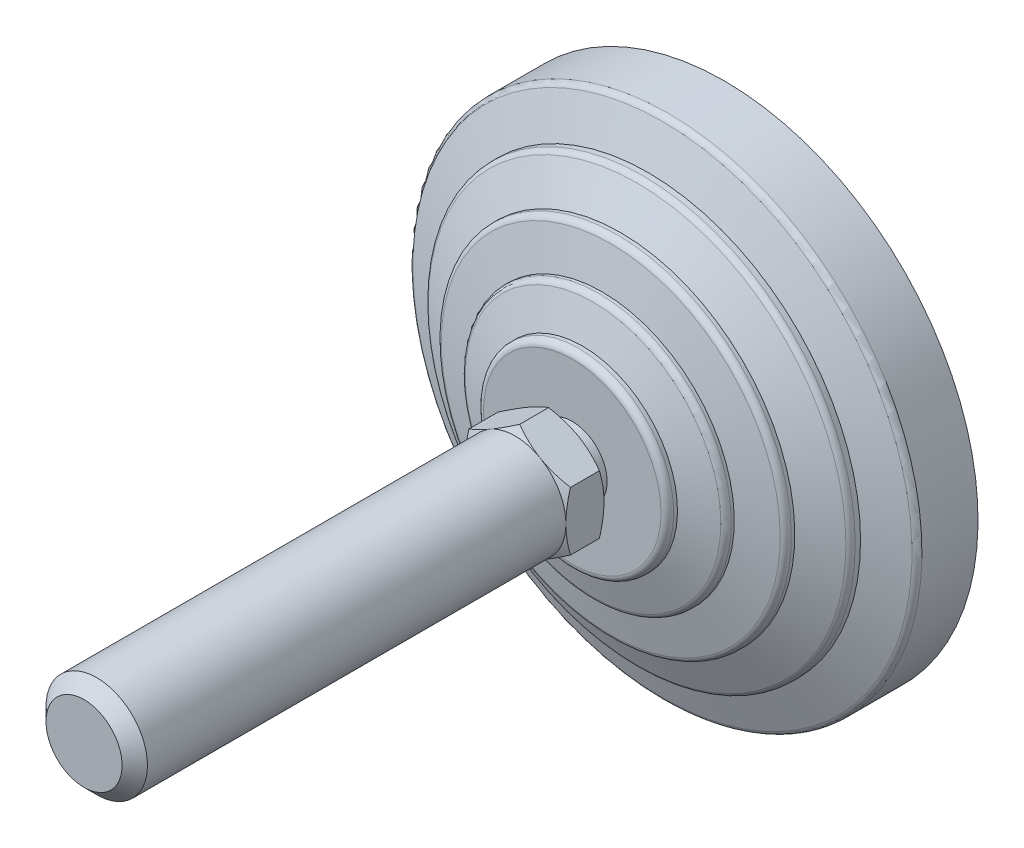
ISO-10303-21;
HEADER;
FILE_DESCRIPTION(('STEP AP214'),'2;1');
FILE_NAME('part.step','',(''),(''),'','','');
FILE_SCHEMA(('AUTOMOTIVE_DESIGN { 1 0 10303 214 1 1 1 1 }'));
ENDSEC;
DATA;
#1=APPLICATION_CONTEXT('core data for automotive mechanical design processes');
#2=APPLICATION_PROTOCOL_DEFINITION('international standard','automotive_design',2000,#1);
#3=PRODUCT_CONTEXT('',#1,'mechanical');
#4=PRODUCT('Part','Part','',(#3));
#5=PRODUCT_RELATED_PRODUCT_CATEGORY('part','',(#4));
#6=PRODUCT_DEFINITION_FORMATION('','',#4);
#7=PRODUCT_DEFINITION_CONTEXT('part definition',#1,'design');
#8=PRODUCT_DEFINITION('design','',#6,#7);
#9=PRODUCT_DEFINITION_SHAPE('','',#8);
#10=(LENGTH_UNIT() NAMED_UNIT(*) SI_UNIT(.MILLI.,.METRE.));
#11=(NAMED_UNIT(*) PLANE_ANGLE_UNIT() SI_UNIT($,.RADIAN.));
#12=(NAMED_UNIT(*) SI_UNIT($,.STERADIAN.) SOLID_ANGLE_UNIT());
#13=UNCERTAINTY_MEASURE_WITH_UNIT(LENGTH_MEASURE(1.E-05),#10,'distance_accuracy_value','');
#14=(GEOMETRIC_REPRESENTATION_CONTEXT(3) GLOBAL_UNCERTAINTY_ASSIGNED_CONTEXT((#13)) GLOBAL_UNIT_ASSIGNED_CONTEXT((#10,
#11,#12)) REPRESENTATION_CONTEXT('',''));
#15=CARTESIAN_POINT('',(0.,0.,0.));
#16=DIRECTION('',(0.,0.,1.));
#17=DIRECTION('',(1.,0.,0.));
#18=AXIS2_PLACEMENT_3D('',#15,#16,#17);
#19=CARTESIAN_POINT('',(-7.76470588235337,0.,30.));
#20=DIRECTION('',(0.,0.,1.));
#21=DIRECTION('',(0.,-1.,0.));
#22=AXIS2_PLACEMENT_3D('',#19,#20,#21);
#23=PLANE('',#22);
#24=CARTESIAN_POINT('',(0.,0.,30.));
#25=DIRECTION('',(0.,0.,-1.));
#26=DIRECTION('',(0.,1.,0.));
#27=AXIS2_PLACEMENT_3D('',#24,#25,#26);
#28=CIRCLE('',#27,5.5000000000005);
#29=CARTESIAN_POINT('',(0.,5.5000000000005,30.));
#30=VERTEX_POINT('',#29);
#31=EDGE_CURVE('E338',#30,#30,#28,.T.);
#32=ORIENTED_EDGE('',*,*,#31,.F.);
#33=EDGE_LOOP('',(#32));
#34=FACE_BOUND('',#33,.T.);
#35=CARTESIAN_POINT('',(0.,0.,30.));
#36=DIRECTION('',(0.,0.,-1.));
#37=DIRECTION('',(-1.,0.,0.));
#38=AXIS2_PLACEMENT_3D('',#35,#36,#37);
#39=CIRCLE('',#38,8.00000000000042);
#40=CARTESIAN_POINT('',(4.,6.92820323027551,30.));
#41=VERTEX_POINT('',#40);
#42=CARTESIAN_POINT('',(8.,0.,30.));
#43=VERTEX_POINT('',#42);
#44=EDGE_CURVE('E491',#41,#43,#39,.T.);
#45=ORIENTED_EDGE('',*,*,#44,.T.);
#46=CARTESIAN_POINT('',(4.,-6.92820323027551,30.));
#47=VERTEX_POINT('',#46);
#48=EDGE_CURVE('E140',#43,#47,#39,.T.);
#49=ORIENTED_EDGE('',*,*,#48,.T.);
#50=CARTESIAN_POINT('',(-4.,-6.92820323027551,30.));
#51=VERTEX_POINT('',#50);
#52=EDGE_CURVE('E139',#47,#51,#39,.T.);
#53=ORIENTED_EDGE('',*,*,#52,.T.);
#54=CARTESIAN_POINT('',(-8.,0.,30.));
#55=VERTEX_POINT('',#54);
#56=EDGE_CURVE('E117',#51,#55,#39,.T.);
#57=ORIENTED_EDGE('',*,*,#56,.T.);
#58=CARTESIAN_POINT('',(-4.,6.92820323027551,30.));
#59=VERTEX_POINT('',#58);
#60=EDGE_CURVE('E105',#55,#59,#39,.T.);
#61=ORIENTED_EDGE('',*,*,#60,.T.);
#62=EDGE_CURVE('E34',#59,#41,#39,.T.);
#63=ORIENTED_EDGE('',*,*,#62,.T.);
#64=EDGE_LOOP('',(#45,#49,#53,#57,#61,#63));
#65=FACE_BOUND('',#64,.T.);
#66=ADVANCED_FACE('F14',(#34,#65),#23,.F.);
#67=CARTESIAN_POINT('',(0.,0.,0.));
#68=DIRECTION('',(0.,0.,-1.));
#69=DIRECTION('',(0.,1.,0.));
#70=AXIS2_PLACEMENT_3D('',#67,#68,#69);
#71=CYLINDRICAL_SURFACE('',#70,5.5000000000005);
#72=CARTESIAN_POINT('',(0.,0.,27.));
#73=DIRECTION('',(0.,0.,-1.));
#74=DIRECTION('',(0.,1.,0.));
#75=AXIS2_PLACEMENT_3D('',#72,#73,#74);
#76=CIRCLE('',#75,5.5000000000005);
#77=CARTESIAN_POINT('',(0.,5.5000000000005,27.));
#78=VERTEX_POINT('',#77);
#79=EDGE_CURVE('E343',#78,#78,#76,.T.);
#80=ORIENTED_EDGE('',*,*,#79,.F.);
#81=EDGE_LOOP('',(#80));
#82=FACE_BOUND('',#81,.T.);
#83=ORIENTED_EDGE('',*,*,#31,.T.);
#84=EDGE_LOOP('',(#83));
#85=FACE_BOUND('',#84,.T.);
#86=ADVANCED_FACE('F305',(#82,#85),#71,.T.);
#87=CARTESIAN_POINT('',(-5.5000000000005,0.,27.));
#88=DIRECTION('',(0.,0.,-1.));
#89=DIRECTION('',(0.,1.,0.));
#90=AXIS2_PLACEMENT_3D('',#87,#88,#89);
#91=PLANE('',#90);
#92=CARTESIAN_POINT('',(0.,0.,27.));
#93=DIRECTION('',(0.,0.,-1.));
#94=DIRECTION('',(0.,1.,0.));
#95=AXIS2_PLACEMENT_3D('',#92,#93,#94);
#96=CIRCLE('',#95,13.9999999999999);
#97=CARTESIAN_POINT('',(0.,13.9999999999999,27.));
#98=VERTEX_POINT('',#97);
#99=EDGE_CURVE('E346',#98,#98,#96,.T.);
#100=ORIENTED_EDGE('',*,*,#99,.F.);
#101=EDGE_LOOP('',(#100));
#102=FACE_BOUND('',#101,.T.);
#103=ORIENTED_EDGE('',*,*,#79,.T.);
#104=EDGE_LOOP('',(#103));
#105=FACE_BOUND('',#104,.T.);
#106=ADVANCED_FACE('F301',(#102,#105),#91,.F.);
#107=CARTESIAN_POINT('',(0.,0.,26.));
#108=DIRECTION('',(0.,0.,-1.));
#109=DIRECTION('',(0.,1.,0.));
#110=AXIS2_PLACEMENT_3D('',#107,#108,#109);
#111=TOROIDAL_SURFACE('',#110,13.9999999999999,1.);
#112=CARTESIAN_POINT('',(0.,0.,26.));
#113=DIRECTION('',(0.,0.,-1.));
#114=DIRECTION('',(0.,1.,0.));
#115=AXIS2_PLACEMENT_3D('',#112,#113,#114);
#116=CIRCLE('',#115,14.9999999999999);
#117=CARTESIAN_POINT('',(0.,14.9999999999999,26.));
#118=VERTEX_POINT('',#117);
#119=EDGE_CURVE('E349',#118,#118,#116,.T.);
#120=ORIENTED_EDGE('',*,*,#119,.F.);
#121=EDGE_LOOP('',(#120));
#122=FACE_BOUND('',#121,.T.);
#123=ORIENTED_EDGE('',*,*,#99,.T.);
#124=EDGE_LOOP('',(#123));
#125=FACE_BOUND('',#124,.T.);
#126=ADVANCED_FACE('F297',(#122,#125),#111,.T.);
#127=CARTESIAN_POINT('',(0.,0.,0.));
#128=DIRECTION('',(0.,0.,-1.));
#129=DIRECTION('',(0.,1.,0.));
#130=AXIS2_PLACEMENT_3D('',#127,#128,#129);
#131=CYLINDRICAL_SURFACE('',#130,14.9999999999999);
#132=CARTESIAN_POINT('',(0.,0.,25.4025287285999));
#133=DIRECTION('',(0.,0.,-1.));
#134=DIRECTION('',(0.,1.,0.));
#135=AXIS2_PLACEMENT_3D('',#132,#133,#134);
#136=CIRCLE('',#135,14.9999999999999);
#137=CARTESIAN_POINT('',(0.,14.9999999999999,25.4025287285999));
#138=VERTEX_POINT('',#137);
#139=EDGE_CURVE('E352',#138,#138,#136,.T.);
#140=ORIENTED_EDGE('',*,*,#139,.F.);
#141=EDGE_LOOP('',(#140));
#142=FACE_BOUND('',#141,.T.);
#143=ORIENTED_EDGE('',*,*,#119,.T.);
#144=EDGE_LOOP('',(#143));
#145=FACE_BOUND('',#144,.T.);
#146=ADVANCED_FACE('F293',(#142,#145),#131,.T.);
#147=CARTESIAN_POINT('',(0.,0.,25.4025287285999));
#148=DIRECTION('',(0.,0.,-1.));
#149=DIRECTION('',(0.,1.,0.));
#150=AXIS2_PLACEMENT_3D('',#147,#148,#149);
#151=CONICAL_SURFACE('',#150,14.9999999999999,1.25589726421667);
#152=CARTESIAN_POINT('',(0.,0.,23.7216684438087));
#153=DIRECTION('',(0.,0.,-1.));
#154=DIRECTION('',(0.,1.,0.));
#155=AXIS2_PLACEMENT_3D('',#152,#153,#154);
#156=CIRCLE('',#155,20.1601635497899);
#157=CARTESIAN_POINT('',(0.,20.1601635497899,23.7216684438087));
#158=VERTEX_POINT('',#157);
#159=EDGE_CURVE('E355',#158,#158,#156,.T.);
#160=ORIENTED_EDGE('',*,*,#159,.F.);
#161=EDGE_LOOP('',(#160));
#162=FACE_BOUND('',#161,.T.);
#163=ORIENTED_EDGE('',*,*,#139,.T.);
#164=EDGE_LOOP('',(#163));
#165=FACE_BOUND('',#164,.T.);
#166=ADVANCED_FACE('F289',(#162,#165),#151,.T.);
#167=CARTESIAN_POINT('',(0.,0.,22.7708407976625));
#168=DIRECTION('',(0.,0.,-1.));
#169=DIRECTION('',(0.,1.,0.));
#170=AXIS2_PLACEMENT_3D('',#167,#168,#169);
#171=TOROIDAL_SURFACE('',#170,19.8504430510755,1.);
#172=CARTESIAN_POINT('',(0.,0.,22.7708407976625));
#173=DIRECTION('',(0.,0.,-1.));
#174=DIRECTION('',(0.,1.,0.));
#175=AXIS2_PLACEMENT_3D('',#172,#173,#174);
#176=CIRCLE('',#175,20.8504430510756);
#177=CARTESIAN_POINT('',(0.,20.8504430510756,22.7708407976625));
#178=VERTEX_POINT('',#177);
#179=EDGE_CURVE('E358',#178,#178,#176,.T.);
#180=ORIENTED_EDGE('',*,*,#179,.F.);
#181=EDGE_LOOP('',(#180));
#182=FACE_BOUND('',#181,.T.);
#183=ORIENTED_EDGE('',*,*,#159,.T.);
#184=EDGE_LOOP('',(#183));
#185=FACE_BOUND('',#184,.T.);
#186=ADVANCED_FACE('F285',(#182,#185),#171,.T.);
#187=CARTESIAN_POINT('',(0.,0.,0.));
#188=DIRECTION('',(0.,0.,-1.));
#189=DIRECTION('',(0.,1.,0.));
#190=AXIS2_PLACEMENT_3D('',#187,#188,#189);
#191=CYLINDRICAL_SURFACE('',#190,20.8504430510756);
#192=CARTESIAN_POINT('',(0.,0.,22.2987385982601));
#193=DIRECTION('',(0.,0.,-1.));
#194=DIRECTION('',(0.,1.,0.));
#195=AXIS2_PLACEMENT_3D('',#192,#193,#194);
#196=CIRCLE('',#195,20.8504430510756);
#197=CARTESIAN_POINT('',(0.,20.8504430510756,22.2987385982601));
#198=VERTEX_POINT('',#197);
#199=EDGE_CURVE('E361',#198,#198,#196,.T.);
#200=ORIENTED_EDGE('',*,*,#199,.F.);
#201=EDGE_LOOP('',(#200));
#202=FACE_BOUND('',#201,.T.);
#203=ORIENTED_EDGE('',*,*,#179,.T.);
#204=EDGE_LOOP('',(#203));
#205=FACE_BOUND('',#204,.T.);
#206=ADVANCED_FACE('F281',(#202,#205),#191,.T.);
#207=CARTESIAN_POINT('',(0.,0.,22.2987385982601));
#208=DIRECTION('',(0.,0.,-1.));
#209=DIRECTION('',(0.,1.,0.));
#210=AXIS2_PLACEMENT_3D('',#207,#208,#209);
#211=CONICAL_SURFACE('',#210,20.8504430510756,1.34067144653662);
#212=CARTESIAN_POINT('',(0.,0.,20.9217501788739));
#213=DIRECTION('',(0.,0.,-1.));
#214=DIRECTION('',(0.,1.,0.));
#215=AXIS2_PLACEMENT_3D('',#212,#213,#214);
#216=CIRCLE('',#215,26.7280991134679);
#217=CARTESIAN_POINT('',(0.,26.7280991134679,20.9217501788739));
#218=VERTEX_POINT('',#217);
#219=EDGE_CURVE('E364',#218,#218,#216,.T.);
#220=ORIENTED_EDGE('',*,*,#219,.F.);
#221=EDGE_LOOP('',(#220));
#222=FACE_BOUND('',#221,.T.);
#223=ORIENTED_EDGE('',*,*,#199,.T.);
#224=EDGE_LOOP('',(#223));
#225=FACE_BOUND('',#224,.T.);
#226=ADVANCED_FACE('F277',(#222,#225),#211,.T.);
#227=CARTESIAN_POINT('',(0.,0.,19.9481122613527));
#228=DIRECTION('',(0.,0.,-1.));
#229=DIRECTION('',(0.,1.,0.));
#230=AXIS2_PLACEMENT_3D('',#227,#228,#229);
#231=TOROIDAL_SURFACE('',#230,26.5,1.);
#232=CARTESIAN_POINT('',(0.,0.,19.9481122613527));
#233=DIRECTION('',(0.,0.,-1.));
#234=DIRECTION('',(0.,1.,0.));
#235=AXIS2_PLACEMENT_3D('',#232,#233,#234);
#236=CIRCLE('',#235,27.5);
#237=CARTESIAN_POINT('',(0.,27.5,19.9481122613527));
#238=VERTEX_POINT('',#237);
#239=EDGE_CURVE('E367',#238,#238,#236,.T.);
#240=ORIENTED_EDGE('',*,*,#239,.F.);
#241=EDGE_LOOP('',(#240));
#242=FACE_BOUND('',#241,.T.);
#243=ORIENTED_EDGE('',*,*,#219,.T.);
#244=EDGE_LOOP('',(#243));
#245=FACE_BOUND('',#244,.T.);
#246=ADVANCED_FACE('F273',(#242,#245),#231,.T.);
#247=CARTESIAN_POINT('',(0.,0.,0.));
#248=DIRECTION('',(0.,0.,-1.));
#249=DIRECTION('',(0.,1.,0.));
#250=AXIS2_PLACEMENT_3D('',#247,#248,#249);
#251=CYLINDRICAL_SURFACE('',#250,27.5);
#252=CARTESIAN_POINT('',(0.,0.,19.4025287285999));
#253=DIRECTION('',(0.,0.,-1.));
#254=DIRECTION('',(0.,1.,0.));
#255=AXIS2_PLACEMENT_3D('',#252,#253,#254);
#256=CIRCLE('',#255,27.5);
#257=CARTESIAN_POINT('',(0.,27.5,19.4025287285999));
#258=VERTEX_POINT('',#257);
#259=EDGE_CURVE('E370',#258,#258,#256,.T.);
#260=ORIENTED_EDGE('',*,*,#259,.F.);
#261=EDGE_LOOP('',(#260));
#262=FACE_BOUND('',#261,.T.);
#263=ORIENTED_EDGE('',*,*,#239,.T.);
#264=EDGE_LOOP('',(#263));
#265=FACE_BOUND('',#264,.T.);
#266=ADVANCED_FACE('F269',(#262,#265),#251,.T.);
#267=CARTESIAN_POINT('',(0.,0.,19.4025287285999));
#268=DIRECTION('',(0.,0.,-1.));
#269=DIRECTION('',(0.,1.,0.));
#270=AXIS2_PLACEMENT_3D('',#267,#268,#269);
#271=CONICAL_SURFACE('',#270,27.5,1.12022914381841);
#272=CARTESIAN_POINT('',(0.,0.,16.7730910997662));
#273=DIRECTION('',(0.,0.,-1.));
#274=DIRECTION('',(0.,1.,0.));
#275=AXIS2_PLACEMENT_3D('',#272,#273,#274);
#276=CIRCLE('',#275,32.935476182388);
#277=CARTESIAN_POINT('',(0.,32.935476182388,16.7730910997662));
#278=VERTEX_POINT('',#277);
#279=EDGE_CURVE('E373',#278,#278,#276,.T.);
#280=ORIENTED_EDGE('',*,*,#279,.F.);
#281=EDGE_LOOP('',(#280));
#282=FACE_BOUND('',#281,.T.);
#283=ORIENTED_EDGE('',*,*,#259,.T.);
#284=EDGE_LOOP('',(#283));
#285=FACE_BOUND('',#284,.T.);
#286=ADVANCED_FACE('F265',(#282,#285),#271,.T.);
#287=CARTESIAN_POINT('',(0.,0.,15.8728908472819));
#288=DIRECTION('',(0.,0.,-1.));
#289=DIRECTION('',(0.,1.,0.));
#290=AXIS2_PLACEMENT_3D('',#287,#288,#289);
#291=TOROIDAL_SURFACE('',#290,32.5,1.);
#292=CARTESIAN_POINT('',(0.,0.,15.8728908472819));
#293=DIRECTION('',(0.,0.,-1.));
#294=DIRECTION('',(0.,1.,0.));
#295=AXIS2_PLACEMENT_3D('',#292,#293,#294);
#296=CIRCLE('',#295,33.5);
#297=CARTESIAN_POINT('',(0.,33.5,15.8728908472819));
#298=VERTEX_POINT('',#297);
#299=EDGE_CURVE('E376',#298,#298,#296,.T.);
#300=ORIENTED_EDGE('',*,*,#299,.F.);
#301=EDGE_LOOP('',(#300));
#302=FACE_BOUND('',#301,.T.);
#303=ORIENTED_EDGE('',*,*,#279,.T.);
#304=EDGE_LOOP('',(#303));
#305=FACE_BOUND('',#304,.T.);
#306=ADVANCED_FACE('F261',(#302,#305),#291,.T.);
#307=CARTESIAN_POINT('',(0.,0.,0.));
#308=DIRECTION('',(0.,0.,-1.));
#309=DIRECTION('',(0.,1.,0.));
#310=AXIS2_PLACEMENT_3D('',#307,#308,#309);
#311=CYLINDRICAL_SURFACE('',#310,33.5);
#312=CARTESIAN_POINT('',(0.,0.,15.0315037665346));
#313=DIRECTION('',(0.,0.,-1.));
#314=DIRECTION('',(0.,1.,0.));
#315=AXIS2_PLACEMENT_3D('',#312,#313,#314);
#316=CIRCLE('',#315,33.5);
#317=CARTESIAN_POINT('',(0.,33.5,15.0315037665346));
#318=VERTEX_POINT('',#317);
#319=EDGE_CURVE('E379',#318,#318,#316,.T.);
#320=ORIENTED_EDGE('',*,*,#319,.F.);
#321=EDGE_LOOP('',(#320));
#322=FACE_BOUND('',#321,.T.);
#323=ORIENTED_EDGE('',*,*,#299,.T.);
#324=EDGE_LOOP('',(#323));
#325=FACE_BOUND('',#324,.T.);
#326=ADVANCED_FACE('F257',(#322,#325),#311,.T.);
#327=CARTESIAN_POINT('',(0.,0.,15.0315037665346));
#328=DIRECTION('',(0.,0.,-1.));
#329=DIRECTION('',(0.,1.,0.));
#330=AXIS2_PLACEMENT_3D('',#327,#328,#329);
#331=CONICAL_SURFACE('',#330,33.5,1.20362249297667);
#332=CARTESIAN_POINT('',(0.,0.,12.7780502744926));
#333=DIRECTION('',(0.,0.,-1.));
#334=DIRECTION('',(0.,1.,0.));
#335=AXIS2_PLACEMENT_3D('',#332,#333,#334);
#336=CIRCLE('',#335,39.3589790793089);
#337=CARTESIAN_POINT('',(0.,39.3589790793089,12.7780502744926));
#338=VERTEX_POINT('',#337);
#339=EDGE_CURVE('E382',#338,#338,#336,.T.);
#340=ORIENTED_EDGE('',*,*,#339,.F.);
#341=EDGE_LOOP('',(#340));
#342=FACE_BOUND('',#341,.T.);
#343=ORIENTED_EDGE('',*,*,#319,.T.);
#344=EDGE_LOOP('',(#343));
#345=FACE_BOUND('',#344,.T.);
#346=ADVANCED_FACE('F253',(#342,#345),#331,.T.);
#347=CARTESIAN_POINT('',(0.,0.,11.8447046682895));
#348=DIRECTION('',(0.,0.,-1.));
#349=DIRECTION('',(0.,1.,0.));
#350=AXIS2_PLACEMENT_3D('',#347,#348,#349);
#351=TOROIDAL_SURFACE('',#350,39.,1.);
#352=CARTESIAN_POINT('',(0.,0.,11.8447046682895));
#353=DIRECTION('',(0.,0.,-1.));
#354=DIRECTION('',(0.,1.,0.));
#355=AXIS2_PLACEMENT_3D('',#352,#353,#354);
#356=CIRCLE('',#355,40.);
#357=CARTESIAN_POINT('',(0.,40.,11.8447046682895));
#358=VERTEX_POINT('',#357);
#359=EDGE_CURVE('E385',#358,#358,#356,.T.);
#360=ORIENTED_EDGE('',*,*,#359,.F.);
#361=EDGE_LOOP('',(#360));
#362=FACE_BOUND('',#361,.T.);
#363=ORIENTED_EDGE('',*,*,#339,.T.);
#364=EDGE_LOOP('',(#363));
#365=FACE_BOUND('',#364,.T.);
#366=ADVANCED_FACE('F249',(#362,#365),#351,.T.);
#367=CARTESIAN_POINT('',(0.,0.,0.));
#368=DIRECTION('',(0.,0.,-1.));
#369=DIRECTION('',(0.,1.,0.));
#370=AXIS2_PLACEMENT_3D('',#367,#368,#369);
#371=CYLINDRICAL_SURFACE('',#370,40.);
#372=CARTESIAN_POINT('',(0.,0.,3.));
#373=DIRECTION('',(0.,0.,-1.));
#374=DIRECTION('',(0.,1.,0.));
#375=AXIS2_PLACEMENT_3D('',#372,#373,#374);
#376=CIRCLE('',#375,40.);
#377=CARTESIAN_POINT('',(0.,40.,3.));
#378=VERTEX_POINT('',#377);
#379=EDGE_CURVE('E388',#378,#378,#376,.T.);
#380=ORIENTED_EDGE('',*,*,#379,.F.);
#381=EDGE_LOOP('',(#380));
#382=FACE_BOUND('',#381,.T.);
#383=ORIENTED_EDGE('',*,*,#359,.T.);
#384=EDGE_LOOP('',(#383));
#385=FACE_BOUND('',#384,.T.);
#386=ADVANCED_FACE('F245',(#382,#385),#371,.T.);
#387=CARTESIAN_POINT('',(-33.5,0.,3.));
#388=DIRECTION('',(0.,0.,1.));
#389=DIRECTION('',(0.,-1.,0.));
#390=AXIS2_PLACEMENT_3D('',#387,#388,#389);
#391=PLANE('',#390);
#392=CARTESIAN_POINT('',(0.,0.,3.));
#393=DIRECTION('',(0.,0.,-1.));
#394=DIRECTION('',(0.,1.,0.));
#395=AXIS2_PLACEMENT_3D('',#392,#393,#394);
#396=CIRCLE('',#395,33.5);
#397=CARTESIAN_POINT('',(0.,33.5,3.));
#398=VERTEX_POINT('',#397);
#399=EDGE_CURVE('E391',#398,#398,#396,.T.);
#400=ORIENTED_EDGE('',*,*,#399,.F.);
#401=EDGE_LOOP('',(#400));
#402=FACE_BOUND('',#401,.T.);
#403=ORIENTED_EDGE('',*,*,#379,.T.);
#404=EDGE_LOOP('',(#403));
#405=FACE_BOUND('',#404,.T.);
#406=ADVANCED_FACE('F241',(#402,#405),#391,.F.);
#407=CARTESIAN_POINT('',(0.,0.,0.));
#408=DIRECTION('',(0.,0.,-1.));
#409=DIRECTION('',(0.,1.,0.));
#410=AXIS2_PLACEMENT_3D('',#407,#408,#409);
#411=CYLINDRICAL_SURFACE('',#410,33.5);
#412=CARTESIAN_POINT('',(0.,0.,0.));
#413=DIRECTION('',(0.,0.,-1.));
#414=DIRECTION('',(0.,1.,0.));
#415=AXIS2_PLACEMENT_3D('',#412,#413,#414);
#416=CIRCLE('',#415,33.5);
#417=CARTESIAN_POINT('',(0.,33.5,0.));
#418=VERTEX_POINT('',#417);
#419=EDGE_CURVE('E394',#418,#418,#416,.T.);
#420=ORIENTED_EDGE('',*,*,#419,.F.);
#421=EDGE_LOOP('',(#420));
#422=FACE_BOUND('',#421,.T.);
#423=ORIENTED_EDGE('',*,*,#399,.T.);
#424=EDGE_LOOP('',(#423));
#425=FACE_BOUND('',#424,.T.);
#426=ADVANCED_FACE('F237',(#422,#425),#411,.T.);
#427=CARTESIAN_POINT('',(0.,0.,0.));
#428=DIRECTION('',(0.,0.,1.));
#429=DIRECTION('',(0.,-1.,0.));
#430=AXIS2_PLACEMENT_3D('',#427,#428,#429);
#431=PLANE('',#430);
#432=ORIENTED_EDGE('',*,*,#419,.T.);
#433=EDGE_LOOP('',(#432));
#434=FACE_BOUND('',#433,.T.);
#435=ADVANCED_FACE('F233',(#434),#431,.F.);
#436=CARTESIAN_POINT('',(0.,0.,31.3561866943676));
#437=DIRECTION('',(0.,0.,1.));
#438=DIRECTION('',(1.,0.,0.));
#439=AXIS2_PLACEMENT_3D('',#436,#437,#438);
#440=CONICAL_SURFACE('',#439,10.348984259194,1.0471975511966);
#441=CARTESIAN_POINT('',(8.,-12.3389670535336,33.8713903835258));
#442=CARTESIAN_POINT('',(8.,-11.9901210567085,33.7024421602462));
#443=CARTESIAN_POINT('',(8.,-11.6404669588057,33.5351335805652));
#444=CARTESIAN_POINT('',(8.,-10.93911254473,33.2047192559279));
#445=CARTESIAN_POINT('',(8.,-10.5874119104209,33.0416141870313));
#446=CARTESIAN_POINT('',(8.,-9.87968957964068,32.7196952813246));
#447=CARTESIAN_POINT('',(8.,-9.52365473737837,32.5609102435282));
#448=CARTESIAN_POINT('',(8.,-8.80872957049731,32.2499291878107));
#449=CARTESIAN_POINT('',(8.,-8.44983938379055,32.0977328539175));
#450=CARTESIAN_POINT('',(8.,-7.71730286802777,31.7970201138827));
#451=CARTESIAN_POINT('',(8.,-7.34354695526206,31.6487691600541));
#452=CARTESIAN_POINT('',(8.,-6.59163837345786,31.363652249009));
#453=CARTESIAN_POINT('',(8.,-6.21348521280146,31.226787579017));
#454=CARTESIAN_POINT('',(8.,-5.45290595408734,30.9680864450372));
#455=CARTESIAN_POINT('',(8.,-5.07049052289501,30.8462189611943));
#456=CARTESIAN_POINT('',(8.,-4.30018872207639,30.6214656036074));
#457=CARTESIAN_POINT('',(8.,-3.91230413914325,30.5185736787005));
#458=CARTESIAN_POINT('',(8.,-3.13292378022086,30.3373055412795));
#459=CARTESIAN_POINT('',(8.,-2.74145924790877,30.2587986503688));
#460=CARTESIAN_POINT('',(8.,-2.15075240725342,30.1627583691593));
#461=CARTESIAN_POINT('',(8.,-1.95325005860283,30.1343636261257));
#462=CARTESIAN_POINT('',(8.,-1.55728687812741,30.0853725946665));
#463=CARTESIAN_POINT('',(8.,-1.35882614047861,30.0647755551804));
#464=CARTESIAN_POINT('',(8.,-0.963774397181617,30.0320450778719));
#465=CARTESIAN_POINT('',(8.,-0.76719215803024,30.0198062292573));
#466=CARTESIAN_POINT('',(8.,-0.373686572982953,30.0036477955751));
#467=CARTESIAN_POINT('',(8.,-0.176763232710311,29.9997280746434));
#468=CARTESIAN_POINT('',(8.,0.217073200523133,30.0003012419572));
#469=CARTESIAN_POINT('',(8.,0.413986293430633,30.0047941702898));
#470=CARTESIAN_POINT('',(8.,0.807450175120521,30.0220840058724));
#471=CARTESIAN_POINT('',(8.,1.00400094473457,30.0348813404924));
#472=CARTESIAN_POINT('',(8.,1.47845599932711,30.0755276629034));
#473=CARTESIAN_POINT('',(8.,1.75601994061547,30.1074324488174));
#474=CARTESIAN_POINT('',(8.,2.30902980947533,30.1860462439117));
#475=CARTESIAN_POINT('',(8.,2.58447543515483,30.2327573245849));
#476=CARTESIAN_POINT('',(8.,3.40735330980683,30.3926181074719));
#477=CARTESIAN_POINT('',(8.,3.95100649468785,30.5254643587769));
#478=CARTESIAN_POINT('',(8.,4.76380137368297,30.7550950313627));
#479=CARTESIAN_POINT('',(8.,5.03717773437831,30.8377464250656));
#480=CARTESIAN_POINT('',(8.,5.58127416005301,31.0114510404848));
#481=CARTESIAN_POINT('',(8.,5.8519942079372,31.1025043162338));
#482=CARTESIAN_POINT('',(8.,6.39086649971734,31.2915670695));
#483=CARTESIAN_POINT('',(8.,6.65901959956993,31.389574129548));
#484=CARTESIAN_POINT('',(8.,7.19311670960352,31.5914095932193));
#485=CARTESIAN_POINT('',(8.,7.45906074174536,31.695237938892));
#486=CARTESIAN_POINT('',(8.,8.07002588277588,31.9402446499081));
#487=CARTESIAN_POINT('',(8.,8.41435897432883,32.0831351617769));
#488=CARTESIAN_POINT('',(8.,9.10022760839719,32.3754977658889));
#489=CARTESIAN_POINT('',(8.,9.44176300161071,32.5249702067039));
#490=CARTESIAN_POINT('',(8.,10.1225289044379,32.8292213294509));
#491=CARTESIAN_POINT('',(8.,10.4617589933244,32.984000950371));
#492=CARTESIAN_POINT('',(8.,11.138235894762,33.2978425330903));
#493=CARTESIAN_POINT('',(8.,11.4754826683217,33.4569045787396));
#494=CARTESIAN_POINT('',(8.,12.1486279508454,33.7786875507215));
#495=CARTESIAN_POINT('',(8.,12.4845248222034,33.9414118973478));
#496=CARTESIAN_POINT('',(8.,13.1548969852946,34.2697655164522));
#497=CARTESIAN_POINT('',(8.,13.4893722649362,34.4353948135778));
#498=CARTESIAN_POINT('',(8.,14.4909152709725,34.9358519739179));
#499=CARTESIAN_POINT('',(8.,15.1561801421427,35.2742876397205));
#500=CARTESIAN_POINT('',(8.,16.4302443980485,35.9307234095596));
#501=CARTESIAN_POINT('',(8.,17.0393146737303,36.2482000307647));
#502=CARTESIAN_POINT('',(8.,18.2551675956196,36.8875464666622));
#503=CARTESIAN_POINT('',(8.,18.8619501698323,37.2094164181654));
#504=CARTESIAN_POINT('',(8.,20.0723222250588,37.8557744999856));
#505=CARTESIAN_POINT('',(8.,20.6759158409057,38.1802548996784));
#506=CARTESIAN_POINT('',(8.,21.8816299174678,38.8318690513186));
#507=CARTESIAN_POINT('',(8.,22.4837504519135,39.1590026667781));
#508=CARTESIAN_POINT('',(8.,23.085323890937,39.4871325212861));
#509=B_SPLINE_CURVE_WITH_KNOTS('',3,(#441,#442,#443,#444,#445,#446,#447,#448,#449,#450,#451,
#452,#453,#454,#455,#456,#457,#458,#459,#460,#461,#462,#463,#464,#465,#466,#467,#468,#469,#470,
#471,#472,#473,#474,#475,#476,#477,#478,#479,#480,#481,#482,#483,#484,#485,#486,#487,#488,#489,
#490,#491,#492,#493,#494,#495,#496,#497,#498,#499,#500,#501,#502,#503,#504,#505,#506,#507,#508),
.UNSPECIFIED.,.F.,.F.,(4,2,2,2,2,2,2,2,2,2,2,2,2,2,2,2,2,2,2,2,2,2,2,2,2,2,2,2,2,2,2,2,2,4),(0.,
1.16282719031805,2.32584024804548,3.4953001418,4.6647038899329,5.87081305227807,
7.07705838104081,8.28076523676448,9.48408757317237,10.6808454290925,11.2793148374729,
11.8777265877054,12.4684446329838,13.0591530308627,13.6498642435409,14.2406058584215,
15.0783057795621,15.9161229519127,17.5927176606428,18.4494408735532,19.3061695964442,
20.1626019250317,21.0190257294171,22.1373479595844,23.2557294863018,24.3743099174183,
25.4929122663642,26.6126066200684,27.7323104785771,29.971451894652,32.0319719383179,
34.0925562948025,36.1483982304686,38.2041350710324),.UNSPECIFIED.);
#510=CARTESIAN_POINT('',(8.,4.61880215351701,30.7145311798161));
#511=VERTEX_POINT('',#510);
#512=EDGE_CURVE('E115',#511,#43,#509,.F.);
#513=ORIENTED_EDGE('',*,*,#512,.T.);
#514=ORIENTED_EDGE('',*,*,#44,.F.);
#515=CARTESIAN_POINT('',(-1.07677915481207,9.85928304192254,31.1073051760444));
#516=CARTESIAN_POINT('',(-0.880069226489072,9.74571251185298,31.02981101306));
#517=CARTESIAN_POINT('',(-0.682571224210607,9.6316869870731,30.9549010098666));
#518=CARTESIAN_POINT('',(-0.285840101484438,9.40263416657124,30.8111789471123));
#519=CARTESIAN_POINT('',(-0.0866063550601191,9.2876065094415,30.7423691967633));
#520=CARTESIAN_POINT('',(0.314440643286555,9.05606191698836,30.6115652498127));
#521=CARTESIAN_POINT('',(0.516261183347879,8.93954077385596,30.5496006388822));
#522=CARTESIAN_POINT('',(0.921657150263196,8.70548530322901,30.4339260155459));
#523=CARTESIAN_POINT('',(1.12523238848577,8.58795108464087,30.3802151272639));
#524=CARTESIAN_POINT('',(1.52775433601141,8.35555492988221,30.2837071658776));
#525=CARTESIAN_POINT('',(1.72664920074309,8.24072292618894,30.2406236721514));
#526=CARTESIAN_POINT('',(2.12584867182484,8.01024500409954,30.1643114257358));
#527=CARTESIAN_POINT('',(2.32615317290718,7.89459914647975,30.1310819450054));
#528=CARTESIAN_POINT('',(2.72751372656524,7.66287352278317,30.075438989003));
#529=CARTESIAN_POINT('',(2.92856765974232,7.54679498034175,30.0530053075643));
#530=CARTESIAN_POINT('',(3.33138792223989,7.31422659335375,30.0195462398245));
#531=CARTESIAN_POINT('',(3.53315422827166,7.1977367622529,30.0085204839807));
#532=CARTESIAN_POINT('',(3.92482869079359,6.97160340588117,29.9985406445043));
#533=CARTESIAN_POINT('',(4.11472391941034,6.86196734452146,29.9989036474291));
#534=CARTESIAN_POINT('',(4.49428515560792,6.64282756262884,30.0100143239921));
#535=CARTESIAN_POINT('',(4.68395116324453,6.53332384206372,30.0207619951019));
#536=CARTESIAN_POINT('',(5.06295355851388,6.31450670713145,30.0523605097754));
#537=CARTESIAN_POINT('',(5.25228891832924,6.20519388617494,30.0732276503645));
#538=CARTESIAN_POINT('',(5.62997718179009,5.98713546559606,30.1245025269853));
#539=CARTESIAN_POINT('',(5.81833009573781,5.87838986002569,30.154910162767));
#540=CARTESIAN_POINT('',(6.39261511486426,5.54682624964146,30.2614019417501));
#541=CARTESIAN_POINT('',(6.7765554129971,5.32515821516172,30.3517564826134));
#542=CARTESIAN_POINT('',(7.53711963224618,4.88604625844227,30.5619936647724));
#543=CARTESIAN_POINT('',(7.91376273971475,4.66859125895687,30.6817827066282));
#544=CARTESIAN_POINT('',(8.28691544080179,4.45315144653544,30.8126962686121));
#545=B_SPLINE_CURVE_WITH_KNOTS('',3,(#515,#516,#517,#518,#519,#520,#521,#522,#523,#524,#525,
#526,#527,#528,#529,#530,#531,#532,#533,#534,#535,#536,#537,#538,#539,#540,#541,#542,#543,#544),
.UNSPECIFIED.,.F.,.F.,(4,2,2,2,2,2,2,2,2,2,2,2,2,2,4),(0.,0.720014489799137,1.44030038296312,
2.16358677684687,2.8867963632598,3.58761424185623,4.28838032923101,4.98782966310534,
5.68725633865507,6.34482763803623,7.00239877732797,7.66103244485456,8.31965919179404,
9.67575189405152,11.027586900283),.UNSPECIFIED.);
#546=EDGE_CURVE('E18',#41,#511,#545,.T.);
#547=ORIENTED_EDGE('',*,*,#546,.T.);
#548=EDGE_LOOP('',(#513,#514,#547));
#549=FACE_BOUND('',#548,.T.);
#550=ADVANCED_FACE('F157',(#549),#440,.T.);
#551=CARTESIAN_POINT('',(-14.4458435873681,0.897292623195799,33.7375832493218));
#552=CARTESIAN_POINT('',(-14.1406851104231,1.07347595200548,33.5680971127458));
#553=CARTESIAN_POINT('',(-13.8347812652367,1.25008961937,33.4003661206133));
#554=CARTESIAN_POINT('',(-13.2210742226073,1.60441354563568,33.0694323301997));
#555=CARTESIAN_POINT('',(-12.9132706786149,1.78212400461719,32.9062303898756));
#556=CARTESIAN_POINT('',(-12.2935399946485,2.13992568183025,32.5844349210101));
#557=CARTESIAN_POINT('',(-11.9815991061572,2.32002483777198,32.4258765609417));
#558=CARTESIAN_POINT('',(-11.3550626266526,2.68175584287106,32.1159432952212));
#559=CARTESIAN_POINT('',(-11.0404671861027,2.86338760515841,31.9645679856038));
#560=CARTESIAN_POINT('',(-10.4052565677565,3.2301266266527,31.6696312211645));
#561=CARTESIAN_POINT('',(-10.0846127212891,3.41525043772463,31.526151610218));
#562=CARTESIAN_POINT('',(-9.43943915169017,3.7877415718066,31.2511195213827));
#563=CARTESIAN_POINT('',(-9.11490897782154,3.97510915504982,31.1195684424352));
#564=CARTESIAN_POINT('',(-8.46219559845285,4.351953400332,30.8721723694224));
#565=CARTESIAN_POINT('',(-8.13402294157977,4.54142397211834,30.756290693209));
#566=CARTESIAN_POINT('',(-7.47299954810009,4.92306600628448,30.5442218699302));
#567=CARTESIAN_POINT('',(-7.14015044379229,5.11523652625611,30.4480280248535));
#568=CARTESIAN_POINT('',(-6.4725859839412,5.50065504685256,30.2810409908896));
#569=CARTESIAN_POINT('',(-6.13791161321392,5.69387938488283,30.2100354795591));
#570=CARTESIAN_POINT('',(-5.63316023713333,5.98529772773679,30.1253459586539));
#571=CARTESIAN_POINT('',(-5.46443096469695,6.0827136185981,30.1007507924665));
#572=CARTESIAN_POINT('',(-5.12626460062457,6.27795405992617,30.0593208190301));
#573=CARTESIAN_POINT('',(-4.95682757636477,6.37577857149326,30.0424852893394));
#574=CARTESIAN_POINT('',(-4.6184257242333,6.57115497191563,30.0170168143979));
#575=CARTESIAN_POINT('',(-4.44946342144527,6.6687054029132,30.0083392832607));
#576=CARTESIAN_POINT('',(-4.11137321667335,6.86390187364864,29.9992242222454));
#577=CARTESIAN_POINT('',(-3.94224531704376,6.96154791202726,29.9987865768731));
#578=CARTESIAN_POINT('',(-3.6041668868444,7.15673758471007,30.0061614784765));
#579=CARTESIAN_POINT('',(-3.43521632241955,7.25428123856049,30.0139719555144));
#580=CARTESIAN_POINT('',(-3.09773710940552,7.44912495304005,30.0376582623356));
#581=CARTESIAN_POINT('',(-2.92920848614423,7.54642499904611,30.0535345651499));
#582=CARTESIAN_POINT('',(-2.51312758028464,7.7866494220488,30.1023701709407));
#583=CARTESIAN_POINT('',(-2.26596700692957,7.92934764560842,30.1398594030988));
#584=CARTESIAN_POINT('',(-1.77374251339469,8.21353358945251,30.2300310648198));
#585=CARTESIAN_POINT('',(-1.52867894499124,8.35502110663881,30.2827159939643));
#586=CARTESIAN_POINT('',(-0.796125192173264,8.77796121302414,30.4608992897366));
#587=CARTESIAN_POINT('',(-0.312249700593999,9.05732685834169,30.606397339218));
#588=CARTESIAN_POINT('',(0.411104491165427,9.47495559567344,30.8549309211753));
#589=CARTESIAN_POINT('',(0.654408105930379,9.61542700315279,30.943947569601));
#590=CARTESIAN_POINT('',(1.13866639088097,9.89501365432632,31.1302768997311));
#591=CARTESIAN_POINT('',(1.37962085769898,10.0341287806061,31.2275902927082));
#592=CARTESIAN_POINT('',(1.85797172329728,10.3103047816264,31.4284729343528));
#593=CARTESIAN_POINT('',(2.09538062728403,10.4473728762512,31.5320028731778));
#594=CARTESIAN_POINT('',(2.56821641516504,10.7203647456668,31.7446813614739));
#595=CARTESIAN_POINT('',(2.80364392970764,10.8562888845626,31.8538280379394));
#596=CARTESIAN_POINT('',(3.03824321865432,10.9917348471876,31.9652481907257));
#597=B_SPLINE_CURVE_WITH_KNOTS('',3,(#551,#552,#553,#554,#555,#556,#557,#558,#559,#560,#561,
#562,#563,#564,#565,#566,#567,#568,#569,#570,#571,#572,#573,#574,#575,#576,#577,#578,#579,#580,
#581,#582,#583,#584,#585,#586,#587,#588,#589,#590,#591,#592,#593,#594,#595,#596),.UNSPECIFIED.,
.F.,.F.,(4,2,2,2,2,2,2,2,2,2,2,2,2,2,2,2,2,2,2,2,2,2,4),(0.,1.17304344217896,2.34630760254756,
3.52690304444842,4.70743201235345,5.89850251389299,7.08971252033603,8.27808374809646,
9.46605000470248,10.6437501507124,11.2327538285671,11.8217026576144,12.407413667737,
12.9931164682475,13.5786723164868,14.1642625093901,15.0273106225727,15.8905007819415,
17.6202751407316,18.5043385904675,19.3884779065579,20.2675188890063,21.1462686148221),.UNSPECIFIED.);
#598=CARTESIAN_POINT('',(0.,9.23760430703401,30.7145311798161));
#599=VERTEX_POINT('',#598);
#600=EDGE_CURVE('E149',#59,#599,#597,.T.);
#601=ORIENTED_EDGE('',*,*,#600,.T.);
#602=EDGE_CURVE('E9',#599,#41,#545,.T.);
#603=ORIENTED_EDGE('',*,*,#602,.T.);
#604=ORIENTED_EDGE('',*,*,#62,.F.);
#605=EDGE_LOOP('',(#601,#603,#604));
#606=FACE_BOUND('',#605,.T.);
#607=ADVANCED_FACE('F484',(#606),#440,.T.);
#608=CARTESIAN_POINT('',(-6.45108638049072,-12.9621407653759,33.7404962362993));
#609=CARTESIAN_POINT('',(-6.14596163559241,-12.7859769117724,33.5710027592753));
#610=CARTESIAN_POINT('',(-5.84009239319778,-12.609383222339,33.4032621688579));
#611=CARTESIAN_POINT('',(-5.22645695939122,-12.2551006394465,33.0723028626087));
#612=CARTESIAN_POINT('',(-4.9186904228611,-12.0774115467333,32.909085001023));
#613=CARTESIAN_POINT('',(-4.29904217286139,-11.7196574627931,32.5872520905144));
#614=CARTESIAN_POINT('',(-3.98714676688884,-11.5395845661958,32.4286720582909));
#615=CARTESIAN_POINT('',(-3.36070464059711,-11.1779080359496,32.1186839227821));
#616=CARTESIAN_POINT('',(-3.04615807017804,-10.9963044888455,31.967275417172));
#617=CARTESIAN_POINT('',(-2.41101422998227,-10.6296040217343,31.6722400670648));
#618=CARTESIAN_POINT('',(-2.09038796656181,-10.4444903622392,31.528695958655));
#619=CARTESIAN_POINT('',(-1.44525316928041,-10.0720216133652,31.2535170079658));
#620=CARTESIAN_POINT('',(-1.12074418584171,-9.88466626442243,31.1218835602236));
#621=CARTESIAN_POINT('',(-0.468073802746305,-9.50784684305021,30.8742990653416));
#622=CARTESIAN_POINT('',(-0.139922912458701,-9.31838883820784,30.7583115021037));
#623=CARTESIAN_POINT('',(0.521056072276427,-8.93677244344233,30.5460033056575));
#624=CARTESIAN_POINT('',(0.853882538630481,-8.74461499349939,30.4496759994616));
#625=CARTESIAN_POINT('',(1.5215006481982,-8.35916549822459,30.2823692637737));
#626=CARTESIAN_POINT('',(1.85625263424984,-8.16589634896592,30.2111847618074));
#627=CARTESIAN_POINT('',(2.3611279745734,-7.87440643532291,30.1262212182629));
#628=CARTESIAN_POINT('',(2.52989976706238,-7.77696599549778,30.1015337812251));
#629=CARTESIAN_POINT('',(2.86815414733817,-7.58167473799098,30.0599191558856));
#630=CARTESIAN_POINT('',(3.03763666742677,-7.48382395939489,30.0429912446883));
#631=CARTESIAN_POINT('',(3.37612800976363,-7.28839589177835,30.0173406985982));
#632=CARTESIAN_POINT('',(3.54513427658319,-7.19082007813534,30.0085732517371));
#633=CARTESIAN_POINT('',(3.88331567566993,-6.99557095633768,29.9992818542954));
#634=CARTESIAN_POINT('',(4.0524908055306,-6.89789764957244,29.9987577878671));
#635=CARTESIAN_POINT('',(4.39066656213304,-6.70265178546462,30.0059653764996));
#636=CARTESIAN_POINT('',(4.5596672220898,-6.60507920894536,30.013694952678));
#637=CARTESIAN_POINT('',(4.89724914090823,-6.41017619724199,30.0372266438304));
#638=CARTESIAN_POINT('',(5.06583037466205,-6.3128457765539,30.0530292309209));
#639=CARTESIAN_POINT('',(5.48177999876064,-6.07269714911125,30.1016620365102));
#640=CARTESIAN_POINT('',(5.72875931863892,-5.93010357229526,30.1390092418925));
#641=CARTESIAN_POINT('',(6.22062803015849,-5.64612303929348,30.2288862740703));
#642=CARTESIAN_POINT('',(6.46551707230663,-5.50473628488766,30.2814185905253));
#643=CARTESIAN_POINT('',(7.19755426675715,-5.08209441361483,30.4591366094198));
#644=CARTESIAN_POINT('',(7.68109610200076,-4.80292140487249,30.6043152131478));
#645=CARTESIAN_POINT('',(8.40396618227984,-4.38557216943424,30.8523763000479));
#646=CARTESIAN_POINT('',(8.6471154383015,-4.24518988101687,30.9412374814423));
#647=CARTESIAN_POINT('',(9.13106636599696,-3.96578068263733,31.127259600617));
#648=CARTESIAN_POINT('',(9.37186783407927,-3.82675389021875,31.2244212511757));
#649=CARTESIAN_POINT('',(9.8499150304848,-3.55075321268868,31.4250058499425));
#650=CARTESIAN_POINT('',(10.0871732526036,-3.41377211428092,31.5283894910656));
#651=CARTESIAN_POINT('',(10.5597076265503,-3.14095426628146,31.7407794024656));
#652=CARTESIAN_POINT('',(10.7949844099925,-3.00511715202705,31.8497837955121));
#653=CARTESIAN_POINT('',(11.0294327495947,-2.86975834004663,31.961063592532));
#654=B_SPLINE_CURVE_WITH_KNOTS('',3,(#608,#609,#610,#611,#612,#613,#614,#615,#616,#617,#618,
#619,#620,#621,#622,#623,#624,#625,#626,#627,#628,#629,#630,#631,#632,#633,#634,#635,#636,#637,
#638,#639,#640,#641,#642,#643,#644,#645,#646,#647,#648,#649,#650,#651,#652,#653),.UNSPECIFIED.,
.F.,.F.,(4,2,2,2,2,2,2,2,2,2,2,2,2,2,2,2,2,2,2,2,2,2,4),(0.,1.17294763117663,2.34611531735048,
3.5265929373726,4.70700425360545,5.89808834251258,7.08931170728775,8.27770489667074,
9.46569405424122,10.6437568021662,11.2329413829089,11.8220710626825,12.4079462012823,
12.9938131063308,13.5795324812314,14.1652861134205,15.0276568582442,15.8901690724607,
17.6185826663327,18.5019953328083,19.3854839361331,20.2638814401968,21.1419874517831),.UNSPECIFIED.);
#655=CARTESIAN_POINT('',(8.,-4.61880215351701,30.7145311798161));
#656=VERTEX_POINT('',#655);
#657=EDGE_CURVE('E135',#656,#47,#654,.F.);
#658=ORIENTED_EDGE('',*,*,#657,.T.);
#659=ORIENTED_EDGE('',*,*,#48,.F.);
#660=EDGE_CURVE('E150',#43,#656,#509,.F.);
#661=ORIENTED_EDGE('',*,*,#660,.T.);
#662=EDGE_LOOP('',(#658,#659,#661));
#663=FACE_BOUND('',#662,.T.);
#664=ADVANCED_FACE('F478',(#663),#440,.T.);
#665=CARTESIAN_POINT('',(0.293576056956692,-9.40710052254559,30.8150340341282));
#666=CARTESIAN_POINT('',(-0.079723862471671,-9.19157571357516,30.6839235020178));
#667=CARTESIAN_POINT('',(-0.456514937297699,-8.9740352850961,30.5639264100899));
#668=CARTESIAN_POINT('',(-1.21738717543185,-8.53474549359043,30.353260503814));
#669=CARTESIAN_POINT('',(-1.60148761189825,-8.3129850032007,30.2626855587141));
#670=CARTESIAN_POINT('',(-2.17601680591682,-7.98128041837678,30.1558680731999));
#671=CARTESIAN_POINT('',(-2.3644483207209,-7.87248943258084,30.125354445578));
#672=CARTESIAN_POINT('',(-2.74229763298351,-7.65433803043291,30.0738702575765));
#673=CARTESIAN_POINT('',(-2.9317154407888,-7.54497760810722,30.0528997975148));
#674=CARTESIAN_POINT('',(-3.31088614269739,-7.32606330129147,30.0211003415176));
#675=CARTESIAN_POINT('',(-3.50063800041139,-7.21651001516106,30.0102550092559));
#676=CARTESIAN_POINT('',(-3.88037486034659,-6.99726883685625,29.9989574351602));
#677=CARTESIAN_POINT('',(-4.07035986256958,-6.88758094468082,29.9985051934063));
#678=CARTESIAN_POINT('',(-4.46200136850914,-6.66146661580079,30.0083066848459));
#679=CARTESIAN_POINT('',(-4.66364540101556,-6.54504737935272,30.0192311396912));
#680=CARTESIAN_POINT('',(-5.06622581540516,-6.31261746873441,30.0524777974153));
#681=CARTESIAN_POINT('',(-5.26716217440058,-6.19660680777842,30.0748003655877));
#682=CARTESIAN_POINT('',(-5.66829149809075,-5.96501468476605,30.1302147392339));
#683=CARTESIAN_POINT('',(-5.86848235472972,-5.84943443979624,30.1633267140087));
#684=CARTESIAN_POINT('',(-6.26745855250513,-5.61908542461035,30.2394010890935));
#685=CARTESIAN_POINT('',(-6.46624378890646,-5.50431671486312,30.2823642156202));
#686=CARTESIAN_POINT('',(-6.86854250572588,-5.27204944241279,30.3786264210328));
#687=CARTESIAN_POINT('',(-7.07200427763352,-5.15458073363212,30.4322117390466));
#688=CARTESIAN_POINT('',(-7.4771758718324,-4.9206548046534,30.5476365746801));
#689=CARTESIAN_POINT('',(-7.67888550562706,-4.80419769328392,30.6094769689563));
#690=CARTESIAN_POINT('',(-8.07971462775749,-4.57277889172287,30.7400361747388));
#691=CARTESIAN_POINT('',(-8.27884138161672,-4.45781300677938,30.8087254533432));
#692=CARTESIAN_POINT('',(-8.6753595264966,-4.22888314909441,30.952209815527));
#693=CARTESIAN_POINT('',(-8.87275154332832,-4.11491881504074,31.0270025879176));
#694=CARTESIAN_POINT('',(-9.06935565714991,-4.00140937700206,31.1043813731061));
#695=B_SPLINE_CURVE_WITH_KNOTS('',3,(#665,#666,#667,#668,#669,#670,#671,#672,#673,#674,#675,
#676,#677,#678,#679,#680,#681,#682,#683,#684,#685,#686,#687,#688,#689,#690,#691,#692,#693,#694),
.UNSPECIFIED.,.F.,.F.,(4,2,2,2,2,2,2,2,2,2,2,2,2,2,4),(0.,1.35249579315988,2.70926518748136,
3.36820566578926,4.02715307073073,4.68503545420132,5.34291784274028,6.04190758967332,
6.74091973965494,7.44124616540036,8.14162423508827,8.86436668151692,9.58718594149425,
10.3070130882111,11.0265689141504),.UNSPECIFIED.);
#696=CARTESIAN_POINT('',(0.,-9.23760430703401,30.7145311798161));
#697=VERTEX_POINT('',#696);
#698=EDGE_CURVE('E429',#697,#51,#695,.T.);
#699=ORIENTED_EDGE('',*,*,#698,.T.);
#700=ORIENTED_EDGE('',*,*,#52,.F.);
#701=EDGE_CURVE('E128',#47,#697,#654,.F.);
#702=ORIENTED_EDGE('',*,*,#701,.T.);
#703=EDGE_LOOP('',(#699,#700,#702));
#704=FACE_BOUND('',#703,.T.);
#705=ADVANCED_FACE('F472',(#704),#440,.T.);
#706=CARTESIAN_POINT('',(-8.,-4.618802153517,30.7145311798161));
#707=VERTEX_POINT('',#706);
#708=EDGE_CURVE('E124',#51,#707,#695,.T.);
#709=ORIENTED_EDGE('',*,*,#708,.T.);
#710=CARTESIAN_POINT('',(-8.,-12.3389670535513,33.8713903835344));
#711=CARTESIAN_POINT('',(-8.,-11.9901210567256,33.7024421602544));
#712=CARTESIAN_POINT('',(-8.,-11.6404669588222,33.5351335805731));
#713=CARTESIAN_POINT('',(-8.,-10.9391125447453,33.204719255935));
#714=CARTESIAN_POINT('',(-8.,-10.5874119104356,33.041614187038));
#715=CARTESIAN_POINT('',(-8.,-9.87968957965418,32.7196952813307));
#716=CARTESIAN_POINT('',(-8.,-9.52365473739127,32.5609102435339));
#717=CARTESIAN_POINT('',(-8.,-8.80872957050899,32.2499291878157));
#718=CARTESIAN_POINT('',(-8.,-8.44983938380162,32.0977328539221));
#719=CARTESIAN_POINT('',(-8.,-7.71730286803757,31.7970201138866));
#720=CARTESIAN_POINT('',(-8.,-7.34354695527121,31.6487691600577));
#721=CARTESIAN_POINT('',(-8.,-6.5916383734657,31.3636522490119));
#722=CARTESIAN_POINT('',(-8.,-6.21348521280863,31.2267875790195));
#723=CARTESIAN_POINT('',(-8.,-5.45290595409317,30.968086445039));
#724=CARTESIAN_POINT('',(-8.,-5.07049052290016,30.8462189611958));
#725=CARTESIAN_POINT('',(-8.,-4.30018872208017,30.6214656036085));
#726=CARTESIAN_POINT('',(-8.,-3.91230413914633,30.5185736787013));
#727=CARTESIAN_POINT('',(-8.,-3.13292378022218,30.3373055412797));
#728=CARTESIAN_POINT('',(-8.,-2.74145924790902,30.2587986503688));
#729=CARTESIAN_POINT('',(-8.,-2.15075240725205,30.1627583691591));
#730=CARTESIAN_POINT('',(-8.,-1.95325005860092,30.1343636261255));
#731=CARTESIAN_POINT('',(-8.,-1.55728687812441,30.0853725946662));
#732=CARTESIAN_POINT('',(-8.,-1.35882614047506,30.0647755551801));
#733=CARTESIAN_POINT('',(-8.,-0.96377439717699,30.0320450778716));
#734=CARTESIAN_POINT('',(-8.,-0.767192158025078,30.019806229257));
#735=CARTESIAN_POINT('',(-8.,-0.373686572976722,30.0036477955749));
#736=CARTESIAN_POINT('',(-8.,-0.176763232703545,29.9997280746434));
#737=CARTESIAN_POINT('',(-8.,0.217073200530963,30.0003012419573));
#738=CARTESIAN_POINT('',(-8.,0.413986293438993,30.00479417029));
#739=CARTESIAN_POINT('',(-8.,0.807450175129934,30.0220840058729));
#740=CARTESIAN_POINT('',(-8.,1.0040009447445,30.0348813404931));
#741=CARTESIAN_POINT('',(-8.,1.47845599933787,30.0755276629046));
#742=CARTESIAN_POINT('',(-8.,1.75601994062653,30.1074324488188));
#743=CARTESIAN_POINT('',(-8.,2.30902980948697,30.1860462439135));
#744=CARTESIAN_POINT('',(-8.,2.58447543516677,30.232757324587));
#745=CARTESIAN_POINT('',(-8.,3.40735330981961,30.3926181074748));
#746=CARTESIAN_POINT('',(-8.,3.95100649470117,30.5254643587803));
#747=CARTESIAN_POINT('',(-8.,4.7638013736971,30.7550950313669));
#748=CARTESIAN_POINT('',(-8.,5.03717773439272,30.83774642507));
#749=CARTESIAN_POINT('',(-8.,5.58127416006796,31.0114510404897));
#750=CARTESIAN_POINT('',(-8.,5.85199420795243,31.102504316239));
#751=CARTESIAN_POINT('',(-8.,6.3908664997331,31.2915670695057));
#752=CARTESIAN_POINT('',(-8.,6.65901959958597,31.389574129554));
#753=CARTESIAN_POINT('',(-8.,7.1931167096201,31.5914095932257));
#754=CARTESIAN_POINT('',(-8.,7.45906074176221,31.6952379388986));
#755=CARTESIAN_POINT('',(-8.,8.07002588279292,31.9402446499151));
#756=CARTESIAN_POINT('',(-8.,8.41435897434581,32.083135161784));
#757=CARTESIAN_POINT('',(-8.,9.10022760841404,32.3754977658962));
#758=CARTESIAN_POINT('',(-8.,9.44176300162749,32.5249702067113));
#759=CARTESIAN_POINT('',(-8.,10.1225289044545,32.8292213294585));
#760=CARTESIAN_POINT('',(-8.,10.461758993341,32.9840009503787));
#761=CARTESIAN_POINT('',(-8.,11.1382358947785,33.297842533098));
#762=CARTESIAN_POINT('',(-8.,11.4754826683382,33.4569045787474));
#763=CARTESIAN_POINT('',(-8.,12.1486279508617,33.7786875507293));
#764=CARTESIAN_POINT('',(-8.,12.4845248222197,33.9414118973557));
#765=CARTESIAN_POINT('',(-8.,13.1548969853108,34.2697655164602));
#766=CARTESIAN_POINT('',(-8.,13.4893722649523,34.4353948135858));
#767=CARTESIAN_POINT('',(-8.,14.4909152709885,34.935851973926));
#768=CARTESIAN_POINT('',(-8.,15.1561801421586,35.2742876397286));
#769=CARTESIAN_POINT('',(-8.,16.4302443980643,35.9307234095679));
#770=CARTESIAN_POINT('',(-8.,17.0393146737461,36.248200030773));
#771=CARTESIAN_POINT('',(-8.,18.2551675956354,36.8875464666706));
#772=CARTESIAN_POINT('',(-7.99999999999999,18.8619501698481,37.2094164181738));
#773=CARTESIAN_POINT('',(-7.99999999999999,20.0723222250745,37.855774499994));
#774=CARTESIAN_POINT('',(-7.99999999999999,20.6759158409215,38.1802548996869));
#775=CARTESIAN_POINT('',(-7.99999999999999,21.8816299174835,38.8318690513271));
#776=CARTESIAN_POINT('',(-8.,22.4837504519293,39.1590026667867));
#777=CARTESIAN_POINT('',(-8.,23.0853238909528,39.4871325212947));
#778=B_SPLINE_CURVE_WITH_KNOTS('',3,(#710,#711,#712,#713,#714,#715,#716,#717,#718,#719,#720,
#721,#722,#723,#724,#725,#726,#727,#728,#729,#730,#731,#732,#733,#734,#735,#736,#737,#738,#739,
#740,#741,#742,#743,#744,#745,#746,#747,#748,#749,#750,#751,#752,#753,#754,#755,#756,#757,#758,
#759,#760,#761,#762,#763,#764,#765,#766,#767,#768,#769,#770,#771,#772,#773,#774,#775,#776,#777),
.UNSPECIFIED.,.F.,.F.,(4,2,2,2,2,2,2,2,2,2,2,2,2,2,2,2,2,2,2,2,2,2,2,2,2,2,2,2,2,2,2,2,2,4),(0.,
1.16282719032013,2.32584024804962,3.49530014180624,4.66470388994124,5.87081305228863,
7.07705838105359,8.28076523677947,9.48408757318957,10.680845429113,11.279314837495,
11.8777265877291,12.4684446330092,13.0591530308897,13.6498642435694,14.2406058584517,
15.0783057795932,15.9161229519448,17.5927176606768,18.4494408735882,19.3061695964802,
20.1626019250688,21.0190257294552,22.1373479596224,23.2557294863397,24.3743099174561,
25.492912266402,26.6126066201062,27.7323104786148,29.9714518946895,32.0319719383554,
34.09255629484,36.1483982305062,38.2041350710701),.UNSPECIFIED.);
#779=EDGE_CURVE('E120',#707,#55,#778,.T.);
#780=ORIENTED_EDGE('',*,*,#779,.T.);
#781=ORIENTED_EDGE('',*,*,#56,.F.);
#782=EDGE_LOOP('',(#709,#780,#781));
#783=FACE_BOUND('',#782,.T.);
#784=ADVANCED_FACE('F121',(#783),#440,.T.);
#785=CARTESIAN_POINT('',(-8.,4.61880215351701,30.7145311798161));
#786=VERTEX_POINT('',#785);
#787=EDGE_CURVE('E109',#55,#786,#778,.T.);
#788=ORIENTED_EDGE('',*,*,#787,.T.);
#789=EDGE_CURVE('E111',#786,#59,#597,.T.);
#790=ORIENTED_EDGE('',*,*,#789,.T.);
#791=ORIENTED_EDGE('',*,*,#60,.F.);
#792=EDGE_LOOP('',(#788,#790,#791));
#793=FACE_BOUND('',#792,.T.);
#794=ADVANCED_FACE('F107',(#793),#440,.T.);
#795=CARTESIAN_POINT('',(-6.00000000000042,0.,104.));
#796=DIRECTION('',(0.,0.,-1.));
#797=DIRECTION('',(0.,1.,0.));
#798=AXIS2_PLACEMENT_3D('',#795,#796,#797);
#799=PLANE('',#798);
#800=CARTESIAN_POINT('',(0.,0.,104.));
#801=DIRECTION('',(0.,0.,-1.));
#802=DIRECTION('',(0.,1.,0.));
#803=AXIS2_PLACEMENT_3D('',#800,#801,#802);
#804=CIRCLE('',#803,6.00000000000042);
#805=CARTESIAN_POINT('',(0.,6.00000000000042,104.));
#806=VERTEX_POINT('',#805);
#807=EDGE_CURVE('E332',#806,#806,#804,.T.);
#808=ORIENTED_EDGE('',*,*,#807,.F.);
#809=EDGE_LOOP('',(#808));
#810=FACE_BOUND('',#809,.T.);
#811=ADVANCED_FACE('F16',(#810),#799,.F.);
#812=CARTESIAN_POINT('',(0.,0.,104.));
#813=DIRECTION('',(0.,0.,-1.));
#814=DIRECTION('',(0.,1.,0.));
#815=AXIS2_PLACEMENT_3D('',#812,#813,#814);
#816=CONICAL_SURFACE('',#815,6.00000000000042,0.785398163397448);
#817=CARTESIAN_POINT('',(0.,0.,102.));
#818=DIRECTION('',(0.,0.,-1.));
#819=DIRECTION('',(0.,1.,0.));
#820=AXIS2_PLACEMENT_3D('',#817,#818,#819);
#821=CIRCLE('',#820,8.00000000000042);
#822=CARTESIAN_POINT('',(0.,8.00000000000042,102.));
#823=VERTEX_POINT('',#822);
#824=EDGE_CURVE('E329',#823,#823,#821,.T.);
#825=ORIENTED_EDGE('',*,*,#824,.F.);
#826=EDGE_LOOP('',(#825));
#827=FACE_BOUND('',#826,.T.);
#828=ORIENTED_EDGE('',*,*,#807,.T.);
#829=EDGE_LOOP('',(#828));
#830=FACE_BOUND('',#829,.T.);
#831=ADVANCED_FACE('F316',(#827,#830),#816,.T.);
#832=CARTESIAN_POINT('',(0.,0.,0.));
#833=DIRECTION('',(0.,0.,-1.));
#834=DIRECTION('',(0.,1.,0.));
#835=AXIS2_PLACEMENT_3D('',#832,#833,#834);
#836=CYLINDRICAL_SURFACE('',#835,8.00000000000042);
#837=ORIENTED_EDGE('',*,*,#824,.T.);
#838=EDGE_LOOP('',(#837));
#839=FACE_BOUND('',#838,.T.);
#840=CARTESIAN_POINT('',(0.,0.,36.));
#841=DIRECTION('',(0.,0.,-1.));
#842=DIRECTION('',(0.,1.,0.));
#843=AXIS2_PLACEMENT_3D('',#840,#841,#842);
#844=CIRCLE('',#843,8.00000000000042);
#845=CARTESIAN_POINT('',(4.,6.92820323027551,36.));
#846=VERTEX_POINT('',#845);
#847=CARTESIAN_POINT('',(8.00000000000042,0.,36.));
#848=VERTEX_POINT('',#847);
#849=EDGE_CURVE('E337',#846,#848,#844,.T.);
#850=ORIENTED_EDGE('',*,*,#849,.F.);
#851=CARTESIAN_POINT('',(-4.00000000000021,6.92820323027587,36.));
#852=VERTEX_POINT('',#851);
#853=EDGE_CURVE('E333',#852,#846,#844,.T.);
#854=ORIENTED_EDGE('',*,*,#853,.F.);
#855=CARTESIAN_POINT('',(0.,0.,36.));
#856=DIRECTION('',(0.,0.,-1.));
#857=DIRECTION('',(-1.,0.,0.));
#858=AXIS2_PLACEMENT_3D('',#855,#856,#857);
#859=CIRCLE('',#858,8.00000000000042);
#860=CARTESIAN_POINT('',(-8.00000000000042,0.,36.));
#861=VERTEX_POINT('',#860);
#862=EDGE_CURVE('E426',#861,#852,#859,.T.);
#863=ORIENTED_EDGE('',*,*,#862,.F.);
#864=CARTESIAN_POINT('',(-4.00000000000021,-6.92820323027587,36.));
#865=VERTEX_POINT('',#864);
#866=EDGE_CURVE('E336',#865,#861,#844,.T.);
#867=ORIENTED_EDGE('',*,*,#866,.F.);
#868=CARTESIAN_POINT('',(4.00000000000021,-6.92820323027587,36.));
#869=VERTEX_POINT('',#868);
#870=EDGE_CURVE('E423',#869,#865,#844,.T.);
#871=ORIENTED_EDGE('',*,*,#870,.F.);
#872=EDGE_CURVE('E500',#848,#869,#844,.T.);
#873=ORIENTED_EDGE('',*,*,#872,.F.);
#874=EDGE_LOOP('',(#850,#854,#863,#867,#871,#873));
#875=FACE_BOUND('',#874,.T.);
#876=ADVANCED_FACE('F313',(#839,#875),#836,.T.);
#877=CARTESIAN_POINT('',(0.,0.,36.));
#878=DIRECTION('',(0.,0.,-1.));
#879=DIRECTION('',(-1.,0.,0.));
#880=AXIS2_PLACEMENT_3D('',#877,#878,#879);
#881=CONICAL_SURFACE('',#880,8.00000000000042,1.0471975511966);
#882=CARTESIAN_POINT('',(-14.4458435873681,0.897292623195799,32.2624167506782));
#883=CARTESIAN_POINT('',(-14.1406851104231,1.07347595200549,32.4319028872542));
#884=CARTESIAN_POINT('',(-13.8347812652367,1.25008961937,32.5996338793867));
#885=CARTESIAN_POINT('',(-13.2210742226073,1.60441354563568,32.9305676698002));
#886=CARTESIAN_POINT('',(-12.9132706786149,1.78212400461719,33.0937696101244));
#887=CARTESIAN_POINT('',(-12.2935399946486,2.13992568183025,33.4155650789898));
#888=CARTESIAN_POINT('',(-11.9815991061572,2.32002483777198,33.5741234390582));
#889=CARTESIAN_POINT('',(-11.3550626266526,2.68175584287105,33.8840567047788));
#890=CARTESIAN_POINT('',(-11.0404671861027,2.8633876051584,34.0354320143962));
#891=CARTESIAN_POINT('',(-10.4052565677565,3.23012662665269,34.3303687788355));
#892=CARTESIAN_POINT('',(-10.0846127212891,3.41525043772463,34.4738483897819));
#893=CARTESIAN_POINT('',(-9.43943915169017,3.7877415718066,34.7488804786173));
#894=CARTESIAN_POINT('',(-9.11490897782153,3.97510915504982,34.8804315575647));
#895=CARTESIAN_POINT('',(-8.46219559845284,4.351953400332,35.1278276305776));
#896=CARTESIAN_POINT('',(-8.13402294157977,4.54142397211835,35.243709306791));
#897=CARTESIAN_POINT('',(-7.47299954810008,4.92306600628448,35.4557781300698));
#898=CARTESIAN_POINT('',(-7.14015044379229,5.11523652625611,35.5519719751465));
#899=CARTESIAN_POINT('',(-6.47258598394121,5.50065504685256,35.7189590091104));
#900=CARTESIAN_POINT('',(-6.13791161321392,5.69387938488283,35.7899645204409));
#901=CARTESIAN_POINT('',(-5.63316023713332,5.98529772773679,35.874654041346));
#902=CARTESIAN_POINT('',(-5.46443096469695,6.0827136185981,35.8992492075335));
#903=CARTESIAN_POINT('',(-5.12626460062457,6.27795405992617,35.9406791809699));
#904=CARTESIAN_POINT('',(-4.95682757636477,6.37577857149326,35.9575147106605));
#905=CARTESIAN_POINT('',(-4.6184257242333,6.57115497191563,35.9829831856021));
#906=CARTESIAN_POINT('',(-4.44946342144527,6.6687054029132,35.9916607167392));
#907=CARTESIAN_POINT('',(-4.11137321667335,6.86390187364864,36.0007757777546));
#908=CARTESIAN_POINT('',(-3.94224531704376,6.96154791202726,36.0012134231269));
#909=CARTESIAN_POINT('',(-3.6041668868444,7.15673758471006,35.9938385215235));
#910=CARTESIAN_POINT('',(-3.43521632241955,7.25428123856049,35.9860280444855));
#911=CARTESIAN_POINT('',(-3.09773710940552,7.44912495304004,35.9623417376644));
#912=CARTESIAN_POINT('',(-2.92920848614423,7.54642499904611,35.9464654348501));
#913=CARTESIAN_POINT('',(-2.51312758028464,7.7866494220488,35.8976298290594));
#914=CARTESIAN_POINT('',(-2.26596700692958,7.92934764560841,35.8601405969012));
#915=CARTESIAN_POINT('',(-1.77374251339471,8.2135335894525,35.7699689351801));
#916=CARTESIAN_POINT('',(-1.52867894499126,8.3550211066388,35.7172840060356));
#917=CARTESIAN_POINT('',(-0.79612519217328,8.77796121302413,35.5391007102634));
#918=CARTESIAN_POINT('',(-0.312249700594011,9.05732685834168,35.393602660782));
#919=CARTESIAN_POINT('',(0.411104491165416,9.47495559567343,35.1450690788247));
#920=CARTESIAN_POINT('',(0.654408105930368,9.61542700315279,35.056052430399));
#921=CARTESIAN_POINT('',(1.13866639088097,9.89501365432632,34.8697231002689));
#922=CARTESIAN_POINT('',(1.37962085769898,10.0341287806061,34.7724097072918));
#923=CARTESIAN_POINT('',(1.85797172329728,10.3103047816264,34.5715270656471));
#924=CARTESIAN_POINT('',(2.09538062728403,10.4473728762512,34.4679971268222));
#925=CARTESIAN_POINT('',(2.56821641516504,10.7203647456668,34.2553186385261));
#926=CARTESIAN_POINT('',(2.80364392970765,10.8562888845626,34.1461719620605));
#927=CARTESIAN_POINT('',(3.03824321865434,10.9917348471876,34.0347518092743));
#928=B_SPLINE_CURVE_WITH_KNOTS('',3,(#882,#883,#884,#885,#886,#887,#888,#889,#890,#891,#892,
#893,#894,#895,#896,#897,#898,#899,#900,#901,#902,#903,#904,#905,#906,#907,#908,#909,#910,#911,
#912,#913,#914,#915,#916,#917,#918,#919,#920,#921,#922,#923,#924,#925,#926,#927),.UNSPECIFIED.,
.F.,.F.,(4,2,2,2,2,2,2,2,2,2,2,2,2,2,2,2,2,2,2,2,2,2,4),(0.,1.17304344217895,2.34630760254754,
3.52690304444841,4.70743201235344,5.89850251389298,7.08971252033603,8.27808374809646,
9.46605000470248,10.6437501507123,11.232753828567,11.8217026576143,12.407413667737,
12.9931164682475,13.5786723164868,14.1642625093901,15.0273106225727,15.8905007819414,
17.6202751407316,18.5043385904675,19.3884779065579,20.2675188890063,21.1462686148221),.UNSPECIFIED.);
#929=CARTESIAN_POINT('',(-8.,4.61880215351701,35.2854688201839));
#930=VERTEX_POINT('',#929);
#931=EDGE_CURVE('E220',#852,#930,#928,.F.);
#932=ORIENTED_EDGE('',*,*,#931,.T.);
#933=CARTESIAN_POINT('',(-8.,-12.3389670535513,32.1286096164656));
#934=CARTESIAN_POINT('',(-8.,-11.9901210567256,32.2975578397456));
#935=CARTESIAN_POINT('',(-8.,-11.6404669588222,32.4648664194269));
#936=CARTESIAN_POINT('',(-8.,-10.9391125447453,32.795280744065));
#937=CARTESIAN_POINT('',(-8.,-10.5874119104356,32.958385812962));
#938=CARTESIAN_POINT('',(-8.,-9.87968957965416,33.2803047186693));
#939=CARTESIAN_POINT('',(-8.,-9.52365473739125,33.4390897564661));
#940=CARTESIAN_POINT('',(-8.,-8.80872957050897,33.7500708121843));
#941=CARTESIAN_POINT('',(-8.,-8.4498393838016,33.9022671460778));
#942=CARTESIAN_POINT('',(-8.,-7.71730286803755,34.2029798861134));
#943=CARTESIAN_POINT('',(-8.,-7.34354695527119,34.3512308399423));
#944=CARTESIAN_POINT('',(-8.,-6.59163837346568,34.6363477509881));
#945=CARTESIAN_POINT('',(-8.,-6.21348521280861,34.7732124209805));
#946=CARTESIAN_POINT('',(-8.,-5.45290595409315,35.0319135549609));
#947=CARTESIAN_POINT('',(-8.,-5.07049052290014,35.1537810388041));
#948=CARTESIAN_POINT('',(-8.,-4.30018872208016,35.3785343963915));
#949=CARTESIAN_POINT('',(-8.,-3.91230413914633,35.4814263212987));
#950=CARTESIAN_POINT('',(-8.,-3.13292378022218,35.6626944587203));
#951=CARTESIAN_POINT('',(-8.,-2.74145924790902,35.7412013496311));
#952=CARTESIAN_POINT('',(-8.,-2.15075240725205,35.8372416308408));
#953=CARTESIAN_POINT('',(-8.,-1.95325005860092,35.8656363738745));
#954=CARTESIAN_POINT('',(-8.,-1.55728687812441,35.9146274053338));
#955=CARTESIAN_POINT('',(-8.,-1.35882614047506,35.9352244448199));
#956=CARTESIAN_POINT('',(-8.,-0.963774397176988,35.9679549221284));
#957=CARTESIAN_POINT('',(-8.,-0.767192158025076,35.980193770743));
#958=CARTESIAN_POINT('',(-8.,-0.373686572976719,35.9963522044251));
#959=CARTESIAN_POINT('',(-8.,-0.176763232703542,36.0002719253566));
#960=CARTESIAN_POINT('',(-8.,0.217073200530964,35.9996987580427));
#961=CARTESIAN_POINT('',(-8.,0.413986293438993,35.99520582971));
#962=CARTESIAN_POINT('',(-8.,0.807450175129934,35.977915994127));
#963=CARTESIAN_POINT('',(-8.,1.0040009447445,35.9651186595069));
#964=CARTESIAN_POINT('',(-8.,1.47845599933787,35.9244723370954));
#965=CARTESIAN_POINT('',(-8.,1.75601994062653,35.8925675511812));
#966=CARTESIAN_POINT('',(-8.,2.30902980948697,35.8139537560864));
#967=CARTESIAN_POINT('',(-8.,2.58447543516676,35.7672426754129));
#968=CARTESIAN_POINT('',(-8.,3.40735330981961,35.6073818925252));
#969=CARTESIAN_POINT('',(-8.,3.95100649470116,35.4745356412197));
#970=CARTESIAN_POINT('',(-8.,4.7638013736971,35.2449049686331));
#971=CARTESIAN_POINT('',(-8.,5.03717773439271,35.16225357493));
#972=CARTESIAN_POINT('',(-8.,5.58127416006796,34.9885489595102));
#973=CARTESIAN_POINT('',(-8.,5.85199420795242,34.897495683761));
#974=CARTESIAN_POINT('',(-8.,6.3908664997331,34.7084329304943));
#975=CARTESIAN_POINT('',(-8.,6.65901959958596,34.610425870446));
#976=CARTESIAN_POINT('',(-8.,7.1931167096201,34.4085904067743));
#977=CARTESIAN_POINT('',(-8.,7.45906074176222,34.3047620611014));
#978=CARTESIAN_POINT('',(-8.,8.07002588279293,34.0597553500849));
#979=CARTESIAN_POINT('',(-8.,8.4143589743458,33.916864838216));
#980=CARTESIAN_POINT('',(-8.,9.10022760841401,33.6245022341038));
#981=CARTESIAN_POINT('',(-8.,9.44176300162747,33.4750297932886));
#982=CARTESIAN_POINT('',(-8.,10.1225289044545,33.1707786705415));
#983=CARTESIAN_POINT('',(-8.,10.461758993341,33.0159990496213));
#984=CARTESIAN_POINT('',(-8.,11.1382358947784,32.7021574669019));
#985=CARTESIAN_POINT('',(-8.,11.4754826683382,32.5430954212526));
#986=CARTESIAN_POINT('',(-8.,12.1486279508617,32.2213124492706));
#987=CARTESIAN_POINT('',(-8.,12.4845248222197,32.0585881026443));
#988=CARTESIAN_POINT('',(-8.,13.1548969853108,31.7302344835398));
#989=CARTESIAN_POINT('',(-8.,13.4893722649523,31.5646051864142));
#990=CARTESIAN_POINT('',(-8.,14.4909152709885,31.064148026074));
#991=CARTESIAN_POINT('',(-8.,15.1561801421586,30.7257123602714));
#992=CARTESIAN_POINT('',(-8.,16.4302443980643,30.0692765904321));
#993=CARTESIAN_POINT('',(-8.,17.0393146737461,29.751799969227));
#994=CARTESIAN_POINT('',(-8.,18.2551675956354,29.1124535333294));
#995=CARTESIAN_POINT('',(-7.99999999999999,18.8619501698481,28.7905835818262));
#996=CARTESIAN_POINT('',(-7.99999999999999,20.0723222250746,28.1442255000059));
#997=CARTESIAN_POINT('',(-7.99999999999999,20.6759158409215,27.8197451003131));
#998=CARTESIAN_POINT('',(-7.99999999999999,21.8816299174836,27.1681309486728));
#999=CARTESIAN_POINT('',(-8.,22.4837504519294,26.8409973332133));
#1000=CARTESIAN_POINT('',(-8.,23.0853238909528,26.5128674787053));
#1001=B_SPLINE_CURVE_WITH_KNOTS('',3,(#933,#934,#935,#936,#937,#938,#939,#940,#941,#942,#943,
#944,#945,#946,#947,#948,#949,#950,#951,#952,#953,#954,#955,#956,#957,#958,#959,#960,#961,#962,
#963,#964,#965,#966,#967,#968,#969,#970,#971,#972,#973,#974,#975,#976,#977,#978,#979,#980,#981,
#982,#983,#984,#985,#986,#987,#988,#989,#990,#991,#992,#993,#994,#995,#996,#997,#998,#999,
#1000),.UNSPECIFIED.,.F.,.F.,(4,2,2,2,2,2,2,2,2,2,2,2,2,2,2,2,2,2,2,2,2,2,2,2,2,2,2,2,2,2,2,2,2,
4),(0.,1.16282719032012,2.32584024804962,3.49530014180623,4.66470388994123,5.87081305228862,
7.07705838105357,8.28076523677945,9.48408757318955,10.680845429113,11.279314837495,
11.8777265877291,12.4684446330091,13.0591530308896,13.6498642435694,14.2406058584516,
15.0783057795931,15.9161229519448,17.5927176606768,18.4494408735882,19.3061695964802,
20.1626019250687,21.0190257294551,22.1373479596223,23.2557294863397,24.3743099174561,
25.4929122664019,26.6126066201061,27.7323104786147,29.9714518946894,32.0319719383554,
34.09255629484,36.1483982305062,38.2041350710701),.UNSPECIFIED.);
#1002=EDGE_CURVE('E218',#930,#861,#1001,.F.);
#1003=ORIENTED_EDGE('',*,*,#1002,.T.);
#1004=ORIENTED_EDGE('',*,*,#862,.T.);
#1005=EDGE_LOOP('',(#932,#1003,#1004));
#1006=FACE_BOUND('',#1005,.T.);
#1007=ADVANCED_FACE('F315',(#1006),#881,.T.);
#1008=CARTESIAN_POINT('',(-8.,-4.61880215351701,35.2854688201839));
#1009=VERTEX_POINT('',#1008);
#1010=EDGE_CURVE('E213',#861,#1009,#1001,.F.);
#1011=ORIENTED_EDGE('',*,*,#1010,.T.);
#1012=CARTESIAN_POINT('',(-9.06935565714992,-4.00140937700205,34.8956186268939));
#1013=CARTESIAN_POINT('',(-8.87275154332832,-4.11491881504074,34.9729974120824));
#1014=CARTESIAN_POINT('',(-8.67535952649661,-4.22888314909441,35.047790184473));
#1015=CARTESIAN_POINT('',(-8.27884138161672,-4.45781300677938,35.1912745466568));
#1016=CARTESIAN_POINT('',(-8.07971462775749,-4.57277889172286,35.2599638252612));
#1017=CARTESIAN_POINT('',(-7.67888550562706,-4.80419769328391,35.3905230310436));
#1018=CARTESIAN_POINT('',(-7.4771758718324,-4.9206548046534,35.4523634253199));
#1019=CARTESIAN_POINT('',(-7.07200427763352,-5.15458073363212,35.5677882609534));
#1020=CARTESIAN_POINT('',(-6.86854250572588,-5.27204944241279,35.6213735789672));
#1021=CARTESIAN_POINT('',(-6.46624378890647,-5.50431671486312,35.7176357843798));
#1022=CARTESIAN_POINT('',(-6.26745855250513,-5.61908542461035,35.7605989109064));
#1023=CARTESIAN_POINT('',(-5.86848235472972,-5.84943443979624,35.8366732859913));
#1024=CARTESIAN_POINT('',(-5.66829149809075,-5.96501468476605,35.8697852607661));
#1025=CARTESIAN_POINT('',(-5.26716217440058,-6.19660680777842,35.9251996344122));
#1026=CARTESIAN_POINT('',(-5.06622581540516,-6.31261746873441,35.9475222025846));
#1027=CARTESIAN_POINT('',(-4.66364540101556,-6.54504737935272,35.9807688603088));
#1028=CARTESIAN_POINT('',(-4.46200136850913,-6.66146661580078,35.9916933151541));
#1029=CARTESIAN_POINT('',(-4.07035986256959,-6.88758094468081,36.0014948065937));
#1030=CARTESIAN_POINT('',(-3.8803748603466,-6.99726883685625,36.0010425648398));
#1031=CARTESIAN_POINT('',(-3.5006380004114,-7.21651001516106,35.9897449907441));
#1032=CARTESIAN_POINT('',(-3.31088614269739,-7.32606330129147,35.9788996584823));
#1033=CARTESIAN_POINT('',(-2.93171544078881,-7.54497760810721,35.9471002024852));
#1034=CARTESIAN_POINT('',(-2.74229763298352,-7.6543380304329,35.9261297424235));
#1035=CARTESIAN_POINT('',(-2.36444832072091,-7.87248943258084,35.8746455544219));
#1036=CARTESIAN_POINT('',(-2.17601680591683,-7.98128041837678,35.8441319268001));
#1037=CARTESIAN_POINT('',(-1.60148761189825,-8.3129850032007,35.7373144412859));
#1038=CARTESIAN_POINT('',(-1.21738717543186,-8.53474549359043,35.6467394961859));
#1039=CARTESIAN_POINT('',(-0.4565149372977,-8.9740352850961,35.43607358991));
#1040=CARTESIAN_POINT('',(-0.0797238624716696,-9.19157571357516,35.3160764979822));
#1041=CARTESIAN_POINT('',(0.293576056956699,-9.40710052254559,35.1849659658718));
#1042=B_SPLINE_CURVE_WITH_KNOTS('',3,(#1012,#1013,#1014,#1015,#1016,#1017,#1018,#1019,#1020,
#1021,#1022,#1023,#1024,#1025,#1026,#1027,#1028,#1029,#1030,#1031,#1032,#1033,#1034,#1035,#1036,
#1037,#1038,#1039,#1040,#1041),.UNSPECIFIED.,.F.,.F.,(4,2,2,2,2,2,2,2,2,2,2,2,2,2,4),(0.,
0.719555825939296,1.43938297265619,2.16220223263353,2.88494467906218,3.58532274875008,
4.2856491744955,4.98466132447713,5.68365107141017,6.34153345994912,6.99941584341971,
7.65836324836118,8.31730372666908,9.67407312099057,11.0265689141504),.UNSPECIFIED.);
#1043=EDGE_CURVE('E219',#1009,#865,#1042,.T.);
#1044=ORIENTED_EDGE('',*,*,#1043,.T.);
#1045=ORIENTED_EDGE('',*,*,#866,.T.);
#1046=EDGE_LOOP('',(#1011,#1044,#1045));
#1047=FACE_BOUND('',#1046,.T.);
#1048=ADVANCED_FACE('F417',(#1047),#881,.T.);
#1049=CARTESIAN_POINT('',(0.,-9.23760430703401,35.2854688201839));
#1050=VERTEX_POINT('',#1049);
#1051=EDGE_CURVE('E207',#865,#1050,#1042,.T.);
#1052=ORIENTED_EDGE('',*,*,#1051,.T.);
#1053=CARTESIAN_POINT('',(-6.45108638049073,-12.9621407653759,32.2595037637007));
#1054=CARTESIAN_POINT('',(-6.14596163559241,-12.7859769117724,32.4289972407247));
#1055=CARTESIAN_POINT('',(-5.84009239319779,-12.609383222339,32.5967378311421));
#1056=CARTESIAN_POINT('',(-5.22645695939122,-12.2551006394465,32.9276971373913));
#1057=CARTESIAN_POINT('',(-4.9186904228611,-12.0774115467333,33.0909149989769));
#1058=CARTESIAN_POINT('',(-4.29904217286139,-11.7196574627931,33.4127479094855));
#1059=CARTESIAN_POINT('',(-3.98714676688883,-11.5395845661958,33.571327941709));
#1060=CARTESIAN_POINT('',(-3.3607046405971,-11.1779080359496,33.8813160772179));
#1061=CARTESIAN_POINT('',(-3.04615807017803,-10.9963044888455,34.032724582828));
#1062=CARTESIAN_POINT('',(-2.41101422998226,-10.6296040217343,34.3277599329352));
#1063=CARTESIAN_POINT('',(-2.0903879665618,-10.4444903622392,34.471304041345));
#1064=CARTESIAN_POINT('',(-1.44525316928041,-10.0720216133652,34.7464829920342));
#1065=CARTESIAN_POINT('',(-1.1207441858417,-9.88466626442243,34.8781164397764));
#1066=CARTESIAN_POINT('',(-0.468073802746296,-9.5078468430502,35.1257009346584));
#1067=CARTESIAN_POINT('',(-0.139922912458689,-9.31838883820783,35.2416884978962));
#1068=CARTESIAN_POINT('',(0.521056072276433,-8.93677244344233,35.4539966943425));
#1069=CARTESIAN_POINT('',(0.85388253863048,-8.74461499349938,35.5503240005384));
#1070=CARTESIAN_POINT('',(1.52150064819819,-8.3591654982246,35.7176307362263));
#1071=CARTESIAN_POINT('',(1.85625263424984,-8.16589634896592,35.7888152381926));
#1072=CARTESIAN_POINT('',(2.3611279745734,-7.87440643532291,35.873778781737));
#1073=CARTESIAN_POINT('',(2.52989976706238,-7.77696599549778,35.8984662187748));
#1074=CARTESIAN_POINT('',(2.86815414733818,-7.58167473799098,35.9400808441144));
#1075=CARTESIAN_POINT('',(3.03763666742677,-7.48382395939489,35.9570087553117));
#1076=CARTESIAN_POINT('',(3.37612800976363,-7.28839589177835,35.9826593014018));
#1077=CARTESIAN_POINT('',(3.54513427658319,-7.19082007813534,35.9914267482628));
#1078=CARTESIAN_POINT('',(3.88331567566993,-6.99557095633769,36.0007181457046));
#1079=CARTESIAN_POINT('',(4.0524908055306,-6.89789764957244,36.0012422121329));
#1080=CARTESIAN_POINT('',(4.39066656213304,-6.70265178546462,35.9940346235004));
#1081=CARTESIAN_POINT('',(4.5596672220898,-6.60507920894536,35.9863050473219));
#1082=CARTESIAN_POINT('',(4.89724914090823,-6.41017619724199,35.9627733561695));
#1083=CARTESIAN_POINT('',(5.06583037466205,-6.3128457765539,35.9469707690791));
#1084=CARTESIAN_POINT('',(5.48177999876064,-6.07269714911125,35.8983379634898));
#1085=CARTESIAN_POINT('',(5.72875931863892,-5.93010357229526,35.8609907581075));
#1086=CARTESIAN_POINT('',(6.22062803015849,-5.64612303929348,35.7711137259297));
#1087=CARTESIAN_POINT('',(6.46551707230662,-5.50473628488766,35.7185814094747));
#1088=CARTESIAN_POINT('',(7.19755426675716,-5.08209441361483,35.5408633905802));
#1089=CARTESIAN_POINT('',(7.68109610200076,-4.80292140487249,35.3956847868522));
#1090=CARTESIAN_POINT('',(8.40396618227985,-4.38557216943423,35.147623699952));
#1091=CARTESIAN_POINT('',(8.64711543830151,-4.24518988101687,35.0587625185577));
#1092=CARTESIAN_POINT('',(9.13106636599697,-3.96578068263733,34.8727403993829));
#1093=CARTESIAN_POINT('',(9.37186783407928,-3.82675389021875,34.7755787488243));
#1094=CARTESIAN_POINT('',(9.84991503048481,-3.55075321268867,34.5749941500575));
#1095=CARTESIAN_POINT('',(10.0871732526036,-3.41377211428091,34.4716105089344));
#1096=CARTESIAN_POINT('',(10.5597076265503,-3.14095426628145,34.2592205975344));
#1097=CARTESIAN_POINT('',(10.7949844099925,-3.00511715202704,34.1502162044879));
#1098=CARTESIAN_POINT('',(11.0294327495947,-2.86975834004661,34.038936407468));
#1099=B_SPLINE_CURVE_WITH_KNOTS('',3,(#1053,#1054,#1055,#1056,#1057,#1058,#1059,#1060,#1061,
#1062,#1063,#1064,#1065,#1066,#1067,#1068,#1069,#1070,#1071,#1072,#1073,#1074,#1075,#1076,#1077,
#1078,#1079,#1080,#1081,#1082,#1083,#1084,#1085,#1086,#1087,#1088,#1089,#1090,#1091,#1092,#1093,
#1094,#1095,#1096,#1097,#1098),.UNSPECIFIED.,.F.,.F.,(4,2,2,2,2,2,2,2,2,2,2,2,2,2,2,2,2,2,2,2,2,
2,4),(0.,1.17294763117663,2.34611531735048,3.5265929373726,4.70700425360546,5.89808834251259,
7.08931170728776,8.27770489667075,9.46569405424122,10.6437568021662,11.2329413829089,
11.8220710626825,12.4079462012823,12.9938131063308,13.5795324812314,14.1652861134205,
15.0276568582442,15.8901690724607,17.6185826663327,18.5019953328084,19.3854839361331,
20.2638814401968,21.1419874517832),.UNSPECIFIED.);
#1100=EDGE_CURVE('E466',#1050,#869,#1099,.T.);
#1101=ORIENTED_EDGE('',*,*,#1100,.T.);
#1102=ORIENTED_EDGE('',*,*,#870,.T.);
#1103=EDGE_LOOP('',(#1052,#1101,#1102));
#1104=FACE_BOUND('',#1103,.T.);
#1105=ADVANCED_FACE('F469',(#1104),#881,.T.);
#1106=CARTESIAN_POINT('',(8.,-4.61880215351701,35.2854688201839));
#1107=VERTEX_POINT('',#1106);
#1108=EDGE_CURVE('E187',#869,#1107,#1099,.T.);
#1109=ORIENTED_EDGE('',*,*,#1108,.T.);
#1110=CARTESIAN_POINT('',(8.,-12.3389670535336,32.1286096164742));
#1111=CARTESIAN_POINT('',(8.,-11.9901210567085,32.2975578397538));
#1112=CARTESIAN_POINT('',(8.,-11.6404669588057,32.4648664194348));
#1113=CARTESIAN_POINT('',(8.,-10.93911254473,32.7952807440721));
#1114=CARTESIAN_POINT('',(8.,-10.5874119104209,32.9583858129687));
#1115=CARTESIAN_POINT('',(8.,-9.87968957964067,33.2803047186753));
#1116=CARTESIAN_POINT('',(8.,-9.52365473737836,33.4390897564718));
#1117=CARTESIAN_POINT('',(8.,-8.8087295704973,33.7500708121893));
#1118=CARTESIAN_POINT('',(8.,-8.44983938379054,33.9022671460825));
#1119=CARTESIAN_POINT('',(8.,-7.71730286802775,34.2029798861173));
#1120=CARTESIAN_POINT('',(8.,-7.34354695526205,34.3512308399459));
#1121=CARTESIAN_POINT('',(8.,-6.59163837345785,34.636347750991));
#1122=CARTESIAN_POINT('',(8.,-6.21348521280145,34.773212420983));
#1123=CARTESIAN_POINT('',(8.,-5.45290595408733,35.0319135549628));
#1124=CARTESIAN_POINT('',(8.,-5.07049052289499,35.1537810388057));
#1125=CARTESIAN_POINT('',(8.,-4.30018872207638,35.3785343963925));
#1126=CARTESIAN_POINT('',(8.,-3.91230413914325,35.4814263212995));
#1127=CARTESIAN_POINT('',(8.,-3.13292378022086,35.6626944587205));
#1128=CARTESIAN_POINT('',(8.,-2.74145924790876,35.7412013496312));
#1129=CARTESIAN_POINT('',(8.,-2.15075240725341,35.8372416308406));
#1130=CARTESIAN_POINT('',(8.,-1.95325005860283,35.8656363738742));
#1131=CARTESIAN_POINT('',(8.,-1.5572868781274,35.9146274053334));
#1132=CARTESIAN_POINT('',(8.,-1.3588261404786,35.9352244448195));
#1133=CARTESIAN_POINT('',(8.,-0.963774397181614,35.967954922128));
#1134=CARTESIAN_POINT('',(8.,-0.767192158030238,35.9801937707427));
#1135=CARTESIAN_POINT('',(8.,-0.373686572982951,35.9963522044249));
#1136=CARTESIAN_POINT('',(8.,-0.176763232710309,36.0002719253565));
#1137=CARTESIAN_POINT('',(8.,0.217073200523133,35.9996987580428));
#1138=CARTESIAN_POINT('',(8.,0.413986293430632,35.9952058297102));
#1139=CARTESIAN_POINT('',(8.,0.807450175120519,35.9779159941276));
#1140=CARTESIAN_POINT('',(8.,1.00400094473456,35.9651186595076));
#1141=CARTESIAN_POINT('',(8.,1.47845599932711,35.9244723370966));
#1142=CARTESIAN_POINT('',(8.,1.75601994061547,35.8925675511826));
#1143=CARTESIAN_POINT('',(8.,2.30902980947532,35.8139537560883));
#1144=CARTESIAN_POINT('',(8.,2.58447543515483,35.7672426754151));
#1145=CARTESIAN_POINT('',(8.,3.40735330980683,35.6073818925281));
#1146=CARTESIAN_POINT('',(8.,3.95100649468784,35.4745356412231));
#1147=CARTESIAN_POINT('',(8.,4.76380137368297,35.2449049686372));
#1148=CARTESIAN_POINT('',(8.,5.03717773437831,35.1622535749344));
#1149=CARTESIAN_POINT('',(8.,5.58127416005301,34.9885489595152));
#1150=CARTESIAN_POINT('',(8.,5.8519942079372,34.8974956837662));
#1151=CARTESIAN_POINT('',(8.,6.39086649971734,34.7084329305));
#1152=CARTESIAN_POINT('',(8.,6.65901959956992,34.6104258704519));
#1153=CARTESIAN_POINT('',(8.,7.19311670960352,34.4085904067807));
#1154=CARTESIAN_POINT('',(8.,7.45906074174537,34.304762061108));
#1155=CARTESIAN_POINT('',(8.,8.07002588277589,34.0597553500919));
#1156=CARTESIAN_POINT('',(8.,8.41435897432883,33.9168648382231));
#1157=CARTESIAN_POINT('',(8.,9.10022760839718,33.6245022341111));
#1158=CARTESIAN_POINT('',(8.,9.44176300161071,33.475029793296));
#1159=CARTESIAN_POINT('',(8.,10.1225289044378,33.1707786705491));
#1160=CARTESIAN_POINT('',(8.,10.4617589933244,33.0159990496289));
#1161=CARTESIAN_POINT('',(8.,11.138235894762,32.7021574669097));
#1162=CARTESIAN_POINT('',(8.,11.4754826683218,32.5430954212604));
#1163=CARTESIAN_POINT('',(8.,12.1486279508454,32.2213124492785));
#1164=CARTESIAN_POINT('',(8.,12.4845248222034,32.0585881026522));
#1165=CARTESIAN_POINT('',(8.,13.1548969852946,31.7302344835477));
#1166=CARTESIAN_POINT('',(8.,13.4893722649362,31.5646051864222));
#1167=CARTESIAN_POINT('',(8.,14.4909152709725,31.0641480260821));
#1168=CARTESIAN_POINT('',(8.,15.1561801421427,30.7257123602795));
#1169=CARTESIAN_POINT('',(8.,16.4302443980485,30.0692765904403));
#1170=CARTESIAN_POINT('',(8.,17.0393146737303,29.7517999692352));
#1171=CARTESIAN_POINT('',(8.,18.2551675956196,29.1124535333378));
#1172=CARTESIAN_POINT('',(8.,18.8619501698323,28.7905835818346));
#1173=CARTESIAN_POINT('',(8.,20.0723222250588,28.1442255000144));
#1174=CARTESIAN_POINT('',(8.,20.6759158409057,27.8197451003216));
#1175=CARTESIAN_POINT('',(8.,21.8816299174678,27.1681309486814));
#1176=CARTESIAN_POINT('',(8.,22.4837504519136,26.8409973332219));
#1177=CARTESIAN_POINT('',(8.,23.085323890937,26.512867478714));
#1178=B_SPLINE_CURVE_WITH_KNOTS('',3,(#1110,#1111,#1112,#1113,#1114,#1115,#1116,#1117,#1118,
#1119,#1120,#1121,#1122,#1123,#1124,#1125,#1126,#1127,#1128,#1129,#1130,#1131,#1132,#1133,#1134,
#1135,#1136,#1137,#1138,#1139,#1140,#1141,#1142,#1143,#1144,#1145,#1146,#1147,#1148,#1149,#1150,
#1151,#1152,#1153,#1154,#1155,#1156,#1157,#1158,#1159,#1160,#1161,#1162,#1163,#1164,#1165,#1166,
#1167,#1168,#1169,#1170,#1171,#1172,#1173,#1174,#1175,#1176,#1177),.UNSPECIFIED.,.F.,.F.,(4,2,2,
2,2,2,2,2,2,2,2,2,2,2,2,2,2,2,2,2,2,2,2,2,2,2,2,2,2,2,2,2,2,4),(0.,1.16282719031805,
2.32584024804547,3.49530014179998,4.66470388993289,5.87081305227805,7.07705838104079,
8.28076523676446,9.48408757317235,10.6808454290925,11.2793148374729,11.8777265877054,
12.4684446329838,13.0591530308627,13.6498642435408,14.2406058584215,15.078305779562,
15.9161229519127,17.5927176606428,18.4494408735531,19.3061695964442,20.1626019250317,
21.0190257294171,22.1373479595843,23.2557294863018,24.3743099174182,25.4929122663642,
26.6126066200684,27.7323104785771,29.971451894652,32.0319719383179,34.0925562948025,
36.1483982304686,38.2041350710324),.UNSPECIFIED.);
#1179=EDGE_CURVE('E179',#1107,#848,#1178,.T.);
#1180=ORIENTED_EDGE('',*,*,#1179,.T.);
#1181=ORIENTED_EDGE('',*,*,#872,.T.);
#1182=EDGE_LOOP('',(#1109,#1180,#1181));
#1183=FACE_BOUND('',#1182,.T.);
#1184=ADVANCED_FACE('F198',(#1183),#881,.T.);
#1185=CARTESIAN_POINT('',(8.,4.61880215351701,35.2854688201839));
#1186=VERTEX_POINT('',#1185);
#1187=EDGE_CURVE('E172',#848,#1186,#1178,.T.);
#1188=ORIENTED_EDGE('',*,*,#1187,.T.);
#1189=CARTESIAN_POINT('',(8.2869154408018,4.45315144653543,35.1873037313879));
#1190=CARTESIAN_POINT('',(7.91376273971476,4.66859125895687,35.3182172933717));
#1191=CARTESIAN_POINT('',(7.53711963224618,4.88604625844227,35.4380063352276));
#1192=CARTESIAN_POINT('',(6.77655541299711,5.32515821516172,35.6482435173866));
#1193=CARTESIAN_POINT('',(6.39261511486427,5.54682624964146,35.7385980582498));
#1194=CARTESIAN_POINT('',(5.81833009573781,5.87838986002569,35.845089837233));
#1195=CARTESIAN_POINT('',(5.62997718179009,5.98713546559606,35.8754974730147));
#1196=CARTESIAN_POINT('',(5.25228891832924,6.20519388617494,35.9267723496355));
#1197=CARTESIAN_POINT('',(5.06295355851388,6.31450670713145,35.9476394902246));
#1198=CARTESIAN_POINT('',(4.68395116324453,6.53332384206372,35.9792380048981));
#1199=CARTESIAN_POINT('',(4.49428515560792,6.64282756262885,35.9899856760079));
#1200=CARTESIAN_POINT('',(4.11472391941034,6.86196734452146,36.0010963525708));
#1201=CARTESIAN_POINT('',(3.92482869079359,6.97160340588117,36.0014593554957));
#1202=CARTESIAN_POINT('',(3.53315422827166,7.1977367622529,35.9914795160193));
#1203=CARTESIAN_POINT('',(3.33138792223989,7.31422659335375,35.9804537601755));
#1204=CARTESIAN_POINT('',(2.92856765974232,7.54679498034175,35.9469946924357));
#1205=CARTESIAN_POINT('',(2.72751372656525,7.66287352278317,35.9245610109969));
#1206=CARTESIAN_POINT('',(2.32615317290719,7.89459914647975,35.8689180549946));
#1207=CARTESIAN_POINT('',(2.12584867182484,8.01024500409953,35.8356885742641));
#1208=CARTESIAN_POINT('',(1.7266492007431,8.24072292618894,35.7593763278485));
#1209=CARTESIAN_POINT('',(1.52775433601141,8.35555492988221,35.7162928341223));
#1210=CARTESIAN_POINT('',(1.12523238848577,8.58795108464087,35.6197848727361));
#1211=CARTESIAN_POINT('',(0.921657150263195,8.70548530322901,35.5660739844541));
#1212=CARTESIAN_POINT('',(0.516261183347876,8.93954077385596,35.4503993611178));
#1213=CARTESIAN_POINT('',(0.31444064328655,9.05606191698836,35.3884347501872));
#1214=CARTESIAN_POINT('',(-0.0866063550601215,9.2876065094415,35.2576308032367));
#1215=CARTESIAN_POINT('',(-0.285840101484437,9.40263416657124,35.1888210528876));
#1216=CARTESIAN_POINT('',(-0.682571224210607,9.6316869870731,35.0450989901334));
#1217=CARTESIAN_POINT('',(-0.880069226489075,9.74571251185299,34.9701889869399));
#1218=CARTESIAN_POINT('',(-1.07677915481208,9.85928304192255,34.8926948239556));
#1219=B_SPLINE_CURVE_WITH_KNOTS('',3,(#1189,#1190,#1191,#1192,#1193,#1194,#1195,#1196,#1197,
#1198,#1199,#1200,#1201,#1202,#1203,#1204,#1205,#1206,#1207,#1208,#1209,#1210,#1211,#1212,#1213,
#1214,#1215,#1216,#1217,#1218),.UNSPECIFIED.,.F.,.F.,(4,2,2,2,2,2,2,2,2,2,2,2,2,2,4),(0.,
1.35183500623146,2.70792770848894,3.36655445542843,4.02518812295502,4.68275926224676,
5.34033056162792,6.03975723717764,6.73920657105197,7.43997265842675,8.14079053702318,
8.86400012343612,9.58728651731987,10.3075724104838,11.027586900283),.UNSPECIFIED.);
#1220=EDGE_CURVE('E180',#1186,#846,#1219,.T.);
#1221=ORIENTED_EDGE('',*,*,#1220,.T.);
#1222=ORIENTED_EDGE('',*,*,#849,.T.);
#1223=EDGE_LOOP('',(#1188,#1221,#1222));
#1224=FACE_BOUND('',#1223,.T.);
#1225=ADVANCED_FACE('F193',(#1224),#881,.T.);
#1226=CARTESIAN_POINT('',(0.,9.23760430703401,35.2854688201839));
#1227=VERTEX_POINT('',#1226);
#1228=EDGE_CURVE('E226',#1227,#852,#928,.F.);
#1229=ORIENTED_EDGE('',*,*,#1228,.T.);
#1230=ORIENTED_EDGE('',*,*,#853,.T.);
#1231=EDGE_CURVE('E181',#846,#1227,#1219,.T.);
#1232=ORIENTED_EDGE('',*,*,#1231,.T.);
#1233=EDGE_LOOP('',(#1229,#1230,#1232));
#1234=FACE_BOUND('',#1233,.T.);
#1235=ADVANCED_FACE('F197',(#1234),#881,.T.);
#1236=CARTESIAN_POINT('',(0.,9.23760430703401,36.));
#1237=DIRECTION('',(0.5,0.866025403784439,0.));
#1238=DIRECTION('',(-0.866025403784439,0.5,0.));
#1239=AXIS2_PLACEMENT_3D('',#1236,#1237,#1238);
#1240=PLANE('',#1239);
#1241=ORIENTED_EDGE('',*,*,#602,.F.);
#1242=DIRECTION('',(0.,0.,-1.));
#1243=VECTOR('',#1242,1.);
#1244=CARTESIAN_POINT('',(0.,9.23760430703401,36.));
#1245=LINE('',#1244,#1243);
#1246=EDGE_CURVE('E397',#1227,#599,#1245,.T.);
#1247=ORIENTED_EDGE('',*,*,#1246,.F.);
#1248=ORIENTED_EDGE('',*,*,#1231,.F.);
#1249=ORIENTED_EDGE('',*,*,#1220,.F.);
#1250=DIRECTION('',(0.,0.,-1.));
#1251=VECTOR('',#1250,1.);
#1252=CARTESIAN_POINT('',(8.,4.61880215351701,36.));
#1253=LINE('',#1252,#1251);
#1254=EDGE_CURVE('E400',#1186,#511,#1253,.T.);
#1255=ORIENTED_EDGE('',*,*,#1254,.T.);
#1256=ORIENTED_EDGE('',*,*,#546,.F.);
#1257=EDGE_LOOP('',(#1241,#1247,#1248,#1249,#1255,#1256));
#1258=FACE_BOUND('',#1257,.T.);
#1259=ADVANCED_FACE('F165',(#1258),#1240,.T.);
#1260=CARTESIAN_POINT('',(8.,4.61880215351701,36.));
#1261=DIRECTION('',(1.,0.,0.));
#1262=DIRECTION('',(0.,1.,0.));
#1263=AXIS2_PLACEMENT_3D('',#1260,#1261,#1262);
#1264=PLANE('',#1263);
#1265=ORIENTED_EDGE('',*,*,#512,.F.);
#1266=ORIENTED_EDGE('',*,*,#1254,.F.);
#1267=ORIENTED_EDGE('',*,*,#1187,.F.);
#1268=ORIENTED_EDGE('',*,*,#1179,.F.);
#1269=DIRECTION('',(0.,0.,-1.));
#1270=VECTOR('',#1269,1.);
#1271=CARTESIAN_POINT('',(8.,-4.61880215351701,36.));
#1272=LINE('',#1271,#1270);
#1273=EDGE_CURVE('E403',#1107,#656,#1272,.T.);
#1274=ORIENTED_EDGE('',*,*,#1273,.T.);
#1275=ORIENTED_EDGE('',*,*,#660,.F.);
#1276=EDGE_LOOP('',(#1265,#1266,#1267,#1268,#1274,#1275));
#1277=FACE_BOUND('',#1276,.T.);
#1278=ADVANCED_FACE('F160',(#1277),#1264,.T.);
#1279=CARTESIAN_POINT('',(8.,-4.61880215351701,36.));
#1280=DIRECTION('',(0.5,-0.866025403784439,0.));
#1281=DIRECTION('',(0.866025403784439,0.5,0.));
#1282=AXIS2_PLACEMENT_3D('',#1279,#1280,#1281);
#1283=PLANE('',#1282);
#1284=ORIENTED_EDGE('',*,*,#657,.F.);
#1285=ORIENTED_EDGE('',*,*,#1273,.F.);
#1286=ORIENTED_EDGE('',*,*,#1108,.F.);
#1287=ORIENTED_EDGE('',*,*,#1100,.F.);
#1288=DIRECTION('',(0.,0.,-1.));
#1289=VECTOR('',#1288,1.);
#1290=CARTESIAN_POINT('',(0.,-9.23760430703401,36.));
#1291=LINE('',#1290,#1289);
#1292=EDGE_CURVE('E406',#1050,#697,#1291,.T.);
#1293=ORIENTED_EDGE('',*,*,#1292,.T.);
#1294=ORIENTED_EDGE('',*,*,#701,.F.);
#1295=EDGE_LOOP('',(#1284,#1285,#1286,#1287,#1293,#1294));
#1296=FACE_BOUND('',#1295,.T.);
#1297=ADVANCED_FACE('F164',(#1296),#1283,.T.);
#1298=CARTESIAN_POINT('',(0.,-9.23760430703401,36.));
#1299=DIRECTION('',(-0.5,-0.866025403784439,0.));
#1300=DIRECTION('',(0.866025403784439,-0.5,0.));
#1301=AXIS2_PLACEMENT_3D('',#1298,#1299,#1300);
#1302=PLANE('',#1301);
#1303=ORIENTED_EDGE('',*,*,#698,.F.);
#1304=ORIENTED_EDGE('',*,*,#1292,.F.);
#1305=ORIENTED_EDGE('',*,*,#1051,.F.);
#1306=ORIENTED_EDGE('',*,*,#1043,.F.);
#1307=DIRECTION('',(0.,0.,-1.));
#1308=VECTOR('',#1307,1.);
#1309=CARTESIAN_POINT('',(-8.,-4.618802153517,36.));
#1310=LINE('',#1309,#1308);
#1311=EDGE_CURVE('E408',#1009,#707,#1310,.T.);
#1312=ORIENTED_EDGE('',*,*,#1311,.T.);
#1313=ORIENTED_EDGE('',*,*,#708,.F.);
#1314=EDGE_LOOP('',(#1303,#1304,#1305,#1306,#1312,#1313));
#1315=FACE_BOUND('',#1314,.T.);
#1316=ADVANCED_FACE('F412',(#1315),#1302,.T.);
#1317=CARTESIAN_POINT('',(-8.,-4.618802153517,36.));
#1318=DIRECTION('',(-1.,0.,0.));
#1319=DIRECTION('',(0.,-1.,0.));
#1320=AXIS2_PLACEMENT_3D('',#1317,#1318,#1319);
#1321=PLANE('',#1320);
#1322=ORIENTED_EDGE('',*,*,#779,.F.);
#1323=ORIENTED_EDGE('',*,*,#1311,.F.);
#1324=ORIENTED_EDGE('',*,*,#1010,.F.);
#1325=ORIENTED_EDGE('',*,*,#1002,.F.);
#1326=DIRECTION('',(0.,0.,-1.));
#1327=VECTOR('',#1326,1.);
#1328=CARTESIAN_POINT('',(-8.,4.61880215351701,36.));
#1329=LINE('',#1328,#1327);
#1330=EDGE_CURVE('E134',#930,#786,#1329,.T.);
#1331=ORIENTED_EDGE('',*,*,#1330,.T.);
#1332=ORIENTED_EDGE('',*,*,#787,.F.);
#1333=EDGE_LOOP('',(#1322,#1323,#1324,#1325,#1331,#1332));
#1334=FACE_BOUND('',#1333,.T.);
#1335=ADVANCED_FACE('F131',(#1334),#1321,.T.);
#1336=CARTESIAN_POINT('',(-8.,4.61880215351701,36.));
#1337=DIRECTION('',(-0.5,0.866025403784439,0.));
#1338=DIRECTION('',(-0.866025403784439,-0.5,0.));
#1339=AXIS2_PLACEMENT_3D('',#1336,#1337,#1338);
#1340=PLANE('',#1339);
#1341=ORIENTED_EDGE('',*,*,#789,.F.);
#1342=ORIENTED_EDGE('',*,*,#1330,.F.);
#1343=ORIENTED_EDGE('',*,*,#931,.F.);
#1344=ORIENTED_EDGE('',*,*,#1228,.F.);
#1345=ORIENTED_EDGE('',*,*,#1246,.T.);
#1346=ORIENTED_EDGE('',*,*,#600,.F.);
#1347=EDGE_LOOP('',(#1341,#1342,#1343,#1344,#1345,#1346));
#1348=FACE_BOUND('',#1347,.T.);
#1349=ADVANCED_FACE('F228',(#1348),#1340,.T.);
#1350=CLOSED_SHELL('',(#66,#86,#106,#126,#146,#166,#186,#206,#226,#246,#266,#286,#306,#326,#346,
#366,#386,#406,#426,#435,#550,#607,#664,#705,#784,#794,#811,#831,#876,#1007,#1048,#1105,#1184,
#1225,#1235,#1259,#1278,#1297,#1316,#1335,#1349));
#1351=MANIFOLD_SOLID_BREP('B1',#1350);
#1352=ADVANCED_BREP_SHAPE_REPRESENTATION('',(#18,#1351),#14);
#1353=SHAPE_DEFINITION_REPRESENTATION(#9,#1352);
ENDSEC;
END-ISO-10303-21;
